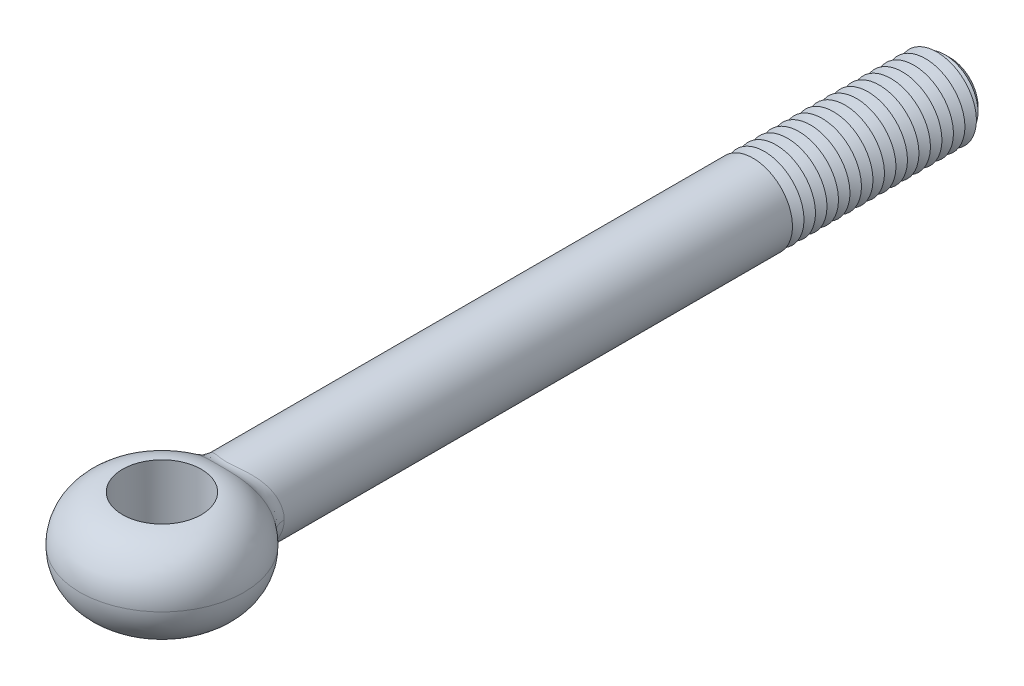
ISO-10303-21;
HEADER;
FILE_DESCRIPTION(('STEP AP214'),'2;1');
FILE_NAME('part.step','',(''),(''),'','','');
FILE_SCHEMA(('AUTOMOTIVE_DESIGN { 1 0 10303 214 1 1 1 1 }'));
ENDSEC;
DATA;
#1=APPLICATION_CONTEXT('core data for automotive mechanical design processes');
#2=APPLICATION_PROTOCOL_DEFINITION('international standard','automotive_design',2000,#1);
#3=PRODUCT_CONTEXT('',#1,'mechanical');
#4=PRODUCT('Part','Part','',(#3));
#5=PRODUCT_RELATED_PRODUCT_CATEGORY('part','',(#4));
#6=PRODUCT_DEFINITION_FORMATION('','',#4);
#7=PRODUCT_DEFINITION_CONTEXT('part definition',#1,'design');
#8=PRODUCT_DEFINITION('design','',#6,#7);
#9=PRODUCT_DEFINITION_SHAPE('','',#8);
#10=(LENGTH_UNIT() NAMED_UNIT(*) SI_UNIT(.MILLI.,.METRE.));
#11=(NAMED_UNIT(*) PLANE_ANGLE_UNIT() SI_UNIT($,.RADIAN.));
#12=(NAMED_UNIT(*) SI_UNIT($,.STERADIAN.) SOLID_ANGLE_UNIT());
#13=UNCERTAINTY_MEASURE_WITH_UNIT(LENGTH_MEASURE(1.E-05),#10,'distance_accuracy_value','');
#14=(GEOMETRIC_REPRESENTATION_CONTEXT(3) GLOBAL_UNCERTAINTY_ASSIGNED_CONTEXT((#13)) GLOBAL_UNIT_ASSIGNED_CONTEXT((#10,
#11,#12)) REPRESENTATION_CONTEXT('',''));
#15=CARTESIAN_POINT('',(0.,0.,0.));
#16=DIRECTION('',(0.,0.,1.));
#17=DIRECTION('',(1.,0.,0.));
#18=AXIS2_PLACEMENT_3D('',#15,#16,#17);
#19=CARTESIAN_POINT('',(0.,0.,-120.));
#20=DIRECTION('',(0.,0.,1.));
#21=DIRECTION('',(1.,0.,0.));
#22=AXIS2_PLACEMENT_3D('',#19,#20,#21);
#23=CYLINDRICAL_SURFACE('',#22,6.);
#24=CARTESIAN_POINT('',(0.,0.,-90.));
#25=DIRECTION('',(0.,0.,-1.));
#26=DIRECTION('',(-1.,0.,0.));
#27=AXIS2_PLACEMENT_3D('',#24,#25,#26);
#28=CIRCLE('',#27,6.);
#29=CARTESIAN_POINT('',(-6.,0.,-90.));
#30=VERTEX_POINT('',#29);
#31=EDGE_CURVE('E79',#30,#30,#28,.T.);
#32=ORIENTED_EDGE('',*,*,#31,.F.);
#33=EDGE_LOOP('',(#32));
#34=FACE_BOUND('',#33,.T.);
#35=CARTESIAN_POINT('',(5.9347688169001,-3.72936552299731,-9.76127797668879));
#36=CARTESIAN_POINT('',(5.01568840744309,-3.30684503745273,-10.6313747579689));
#37=CARTESIAN_POINT('',(4.83579180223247,-3.55177668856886,-11.9305846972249));
#38=CARTESIAN_POINT('',(6.04219931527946,-3.59564214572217,-9.79450956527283));
#39=CARTESIAN_POINT('',(5.09919553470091,-3.1795874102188,-10.6682119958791));
#40=CARTESIAN_POINT('',(4.92935060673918,-3.42442109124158,-11.9860495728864));
#41=CARTESIAN_POINT('',(6.1438473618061,-3.45763550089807,-9.82611020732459));
#42=CARTESIAN_POINT('',(5.17725322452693,-3.05002694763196,-10.702840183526));
#43=CARTESIAN_POINT('',(5.01812074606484,-3.29298619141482,-12.0386936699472));
#44=CARTESIAN_POINT('',(6.33498015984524,-3.17385997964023,-9.8857417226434));
#45=CARTESIAN_POINT('',(5.32290004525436,-2.78639390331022,-10.7677279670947));
#46=CARTESIAN_POINT('',(5.1853986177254,-3.02272379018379,-12.1378881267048));
#47=CARTESIAN_POINT('',(6.42446179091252,-3.02808912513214,-9.91377167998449));
#48=CARTESIAN_POINT('',(5.39041764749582,-2.65235488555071,-10.7979569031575));
#49=CARTESIAN_POINT('',(5.26390371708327,-2.88389440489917,-12.1844369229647));
#50=CARTESIAN_POINT('',(6.59063414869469,-2.72961135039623,-9.96594490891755));
#51=CARTESIAN_POINT('',(5.51491014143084,-2.38053035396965,-10.8538721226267));
#52=CARTESIAN_POINT('',(5.40994102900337,-2.5996298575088,-12.270973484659));
#53=CARTESIAN_POINT('',(6.66732079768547,-2.57690223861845,-9.99008694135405));
#54=CARTESIAN_POINT('',(5.57181683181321,-2.24279354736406,-10.8795284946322));
#55=CARTESIAN_POINT('',(5.47746974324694,-2.45419260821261,-12.3109591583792));
#56=CARTESIAN_POINT('',(6.80727548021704,-2.26566063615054,-10.0342164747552));
#57=CARTESIAN_POINT('',(5.67502497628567,-1.96438787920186,-10.9261769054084));
#58=CARTESIAN_POINT('',(5.60087770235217,-2.1577720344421,-12.3839763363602));
#59=CARTESIAN_POINT('',(6.87054514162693,-2.10712885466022,-10.0542044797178));
#60=CARTESIAN_POINT('',(5.72126980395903,-1.82378259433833,-10.9471437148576));
#61=CARTESIAN_POINT('',(5.65675836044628,-2.00678938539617,-12.4170086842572));
#62=CARTESIAN_POINT('',(7.03602672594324,-1.63406973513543,-10.1065323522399));
#63=CARTESIAN_POINT('',(5.84177866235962,-1.4066595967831,-11.0018788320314));
#64=CARTESIAN_POINT('',(5.80305576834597,-1.55625689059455,-12.5034220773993));
#65=CARTESIAN_POINT('',(7.11911563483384,-1.31267241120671,-10.1328771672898));
#66=CARTESIAN_POINT('',(5.90112324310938,-1.12766751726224,-11.0289752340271));
#67=CARTESIAN_POINT('',(5.87671572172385,-1.2501642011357,-12.5468355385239));
#68=CARTESIAN_POINT('',(7.23011866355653,-0.660856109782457,-10.1680856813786));
#69=CARTESIAN_POINT('',(5.98031743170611,-0.565466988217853,-11.0651706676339));
#70=CARTESIAN_POINT('',(5.97517391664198,-0.629386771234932,-12.6048310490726));
#71=CARTESIAN_POINT('',(7.25807152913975,-0.33044363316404,-10.1769616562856));
#72=CARTESIAN_POINT('',(6.00000388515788,-0.282923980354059,-11.0741952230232));
#73=CARTESIAN_POINT('',(6.0000064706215,-0.314708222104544,-12.6194333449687));
#74=CARTESIAN_POINT('',(7.25805738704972,0.335912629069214,-10.1769567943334));
#75=CARTESIAN_POINT('',(5.99999605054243,0.287606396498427,-11.0741911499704));
#76=CARTESIAN_POINT('',(5.99999342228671,0.319916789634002,-12.6194255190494));
#77=CARTESIAN_POINT('',(7.22915722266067,0.671857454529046,-10.1677796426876));
#78=CARTESIAN_POINT('',(5.97964504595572,0.574876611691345,-11.0648614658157));
#79=CARTESIAN_POINT('',(5.97431882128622,0.63986424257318,-12.6043279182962));
#80=CARTESIAN_POINT('',(7.11452740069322,1.33399050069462,-10.131423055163));
#81=CARTESIAN_POINT('',(5.89784251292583,1.14610230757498,-11.0274778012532));
#82=CARTESIAN_POINT('',(5.87264847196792,1.2704671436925,-12.5444393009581));
#83=CARTESIAN_POINT('',(7.02877559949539,1.66017486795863,-10.1042366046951));
#84=CARTESIAN_POINT('',(5.83657851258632,1.42936262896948,-10.9995093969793));
#85=CARTESIAN_POINT('',(5.79663311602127,1.58111892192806,-12.4996367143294));
#86=CARTESIAN_POINT('',(6.80343893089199,2.2930418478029,-10.0329875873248));
#87=CARTESIAN_POINT('',(5.67253761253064,1.98731296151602,-10.9250177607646));
#88=CARTESIAN_POINT('',(5.59744490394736,2.1838493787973,-12.3819651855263));
#89=CARTESIAN_POINT('',(6.66393326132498,2.59975238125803,-9.98894984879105));
#90=CARTESIAN_POINT('',(5.57019974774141,2.2614449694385,-10.8786920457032));
#91=CARTESIAN_POINT('',(5.47434142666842,2.47595464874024,-12.3091375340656));
#92=CARTESIAN_POINT('',(6.33535121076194,3.18625883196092,-9.88580293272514));
#93=CARTESIAN_POINT('',(5.32389744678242,2.79589244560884,-10.768093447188));
#94=CARTESIAN_POINT('',(5.18560859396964,3.03453222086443,-12.1380393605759));
#95=CARTESIAN_POINT('',(6.14627999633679,3.4660575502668,-9.82669532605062));
#96=CARTESIAN_POINT('',(5.18043230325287,3.05583228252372,-10.7040397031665));
#97=CARTESIAN_POINT('',(5.01998367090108,3.30100719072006,-12.0397714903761));
#98=CARTESIAN_POINT('',(5.7172577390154,4.00014270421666,-9.69400494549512));
#99=CARTESIAN_POINT('',(4.84766875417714,3.56284891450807,-10.5572649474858));
#100=CARTESIAN_POINT('',(4.64637499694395,3.8096597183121,-11.8183006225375));
#101=CARTESIAN_POINT('',(5.47601553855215,4.2534802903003,-9.62005911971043));
#102=CARTESIAN_POINT('',(4.65772328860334,3.80925143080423,-10.4742896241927));
#103=CARTESIAN_POINT('',(4.43732293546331,4.05093360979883,-11.694469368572));
#104=CARTESIAN_POINT('',(5.08259146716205,4.60342640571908,-9.50208552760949));
#105=CARTESIAN_POINT('',(4.34080391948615,4.15825147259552,-10.3388173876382));
#106=CARTESIAN_POINT('',(4.09924731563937,4.38421562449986,-11.4959320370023));
#107=CARTESIAN_POINT('',(4.9460782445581,4.71513594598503,-9.46155286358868));
#108=CARTESIAN_POINT('',(4.23020168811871,4.27084293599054,-10.2919789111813));
#109=CARTESIAN_POINT('',(3.98237779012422,4.49060566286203,-11.4275663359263));
#110=CARTESIAN_POINT('',(4.66296513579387,4.92813376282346,-9.37875537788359));
#111=CARTESIAN_POINT('',(3.99884628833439,4.48804462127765,-10.1953948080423));
#112=CARTESIAN_POINT('',(3.74115278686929,4.6934607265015,-11.2875507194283));
#113=CARTESIAN_POINT('',(4.5163679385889,5.0294247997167,-9.33649101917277));
#114=CARTESIAN_POINT('',(3.87815279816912,4.5926858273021,-10.1456674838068));
#115=CARTESIAN_POINT('',(3.61679930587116,4.78992838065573,-11.2159016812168));
#116=CARTESIAN_POINT('',(4.20225124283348,5.22831182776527,-9.24781094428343));
#117=CARTESIAN_POINT('',(3.61758964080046,4.80051594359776,-10.0403893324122));
#118=CARTESIAN_POINT('',(3.35180476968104,4.97934459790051,-11.0651470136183));
#119=CARTESIAN_POINT('',(4.03398632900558,5.3250780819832,-9.20131965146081));
#120=CARTESIAN_POINT('',(3.47696557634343,4.90311397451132,-9.98467073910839));
#121=CARTESIAN_POINT('',(3.21063957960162,5.07150293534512,-10.9858822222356));
#122=CARTESIAN_POINT('',(3.68652352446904,5.50578905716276,-9.10838168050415));
#123=CARTESIAN_POINT('',(3.18454628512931,5.09703954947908,-9.87225560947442));
#124=CARTESIAN_POINT('',(2.92111983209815,5.24360862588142,-10.8269291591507));
#125=CARTESIAN_POINT('',(3.50732357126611,5.5897313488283,-9.06193501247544));
#126=CARTESIAN_POINT('',(3.03278104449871,5.18843564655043,-9.81555489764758));
#127=CARTESIAN_POINT('',(2.77276391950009,5.32355366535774,-10.7472408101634));
#128=CARTESIAN_POINT('',(3.13794087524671,5.74446425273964,-8.97062224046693));
#129=CARTESIAN_POINT('',(2.71821702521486,5.35884982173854,-9.70314483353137));
#130=CARTESIAN_POINT('',(2.46931336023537,5.47091833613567,-10.5900722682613));
#131=CARTESIAN_POINT('',(2.94775184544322,5.81524723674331,-8.92575706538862));
#132=CARTESIAN_POINT('',(2.55541416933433,5.43794512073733,-9.64741385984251));
#133=CARTESIAN_POINT('',(2.31421486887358,5.53833070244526,-10.5125933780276));
#134=CARTESIAN_POINT('',(2.55657851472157,5.9431564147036,-8.83975050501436));
#135=CARTESIAN_POINT('',(2.21925064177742,5.58238081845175,-9.53980556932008));
#136=CARTESIAN_POINT('',(1.99786735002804,5.66014896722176,-10.3636052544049));
#137=CARTESIAN_POINT('',(2.35559801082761,6.00028737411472,-8.79860782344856));
#138=CARTESIAN_POINT('',(2.04585622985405,5.64781946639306,-9.48788433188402));
#139=CARTESIAN_POINT('',(1.83662049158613,5.71455940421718,-10.2920939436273));
#140=CARTESIAN_POINT('',(1.85774191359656,6.12093796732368,-8.70719486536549));
#141=CARTESIAN_POINT('',(1.61559271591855,5.78713197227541,-9.37194513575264));
#142=CARTESIAN_POINT('',(1.4406271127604,5.82946473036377,-10.1327613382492));
#143=CARTESIAN_POINT('',(1.55532271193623,6.17747996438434,-8.6600942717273));
#144=CARTESIAN_POINT('',(1.3529723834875,5.8538439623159,-9.31142342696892));
#145=CARTESIAN_POINT('',(1.20284157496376,5.88331425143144,-10.0502669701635));
#146=CARTESIAN_POINT('',(1.0891409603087,6.23930337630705,-8.60649289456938));
#147=CARTESIAN_POINT('',(0.947579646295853,5.92726352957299,-9.242285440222));
#148=CARTESIAN_POINT('',(0.83982684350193,5.94219369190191,-9.95617208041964));
#149=CARTESIAN_POINT('',(0.931962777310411,6.25606948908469,-8.59147969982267));
#150=CARTESIAN_POINT('',(0.810874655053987,5.94729550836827,-9.22285403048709));
#151=CARTESIAN_POINT('',(0.718001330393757,5.95816141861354,-9.92977025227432));
#152=CARTESIAN_POINT('',(0.614462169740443,6.2817502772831,-8.56819097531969));
#153=CARTESIAN_POINT('',(0.534722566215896,5.97803723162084,-9.19268813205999));
#154=CARTESIAN_POINT('',(0.472694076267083,5.98261931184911,-9.88878715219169));
#155=CARTESIAN_POINT('',(0.454140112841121,6.29066586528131,-8.5599146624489));
#156=CARTESIAN_POINT('',(0.395193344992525,5.98876738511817,-9.18193414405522));
#157=CARTESIAN_POINT('',(0.349212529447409,5.9911103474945,-9.87420450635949));
#158=CARTESIAN_POINT('',(0.131049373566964,6.30047562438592,-8.55079683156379));
#159=CARTESIAN_POINT('',(0.114068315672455,6.00056854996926,-9.17009294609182));
#160=CARTESIAN_POINT('',(0.100687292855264,6.00045297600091,-9.85813795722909));
#161=CARTESIAN_POINT('',(-0.0317286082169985,6.30131187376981,-8.55000899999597));
#162=CARTESIAN_POINT('',(-0.0276309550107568,6.00157787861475,-9.16906745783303));
#163=CARTESIAN_POINT('',(-0.02436125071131,6.00124940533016,-9.85674863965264));
#164=CARTESIAN_POINT('',(-0.356412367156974,6.29479284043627,-8.55608280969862));
#165=CARTESIAN_POINT('',(-0.31015318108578,5.99373179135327,-9.1769575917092));
#166=CARTESIAN_POINT('',(-0.274003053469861,5.9950408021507,-9.86745275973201));
#167=CARTESIAN_POINT('',(-0.518318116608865,6.28743729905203,-8.56294469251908));
#168=CARTESIAN_POINT('',(-0.451073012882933,5.98487067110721,-9.18587895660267));
#169=CARTESIAN_POINT('',(-0.398596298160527,5.98803552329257,-9.87954662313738));
#170=CARTESIAN_POINT('',(-0.839832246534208,6.26466677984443,-8.583729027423));
#171=CARTESIAN_POINT('',(-0.730746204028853,5.95757663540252,-9.21281914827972));
#172=CARTESIAN_POINT('',(-0.646718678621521,5.96634931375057,-9.91613502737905));
#173=CARTESIAN_POINT('',(-0.999430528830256,6.24922351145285,-8.59767625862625));
#174=CARTESIAN_POINT('',(-0.869577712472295,5.93909230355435,-9.23088715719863));
#175=CARTESIAN_POINT('',(-0.770242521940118,5.95164143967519,-9.94067308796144));
#176=CARTESIAN_POINT('',(-1.31437481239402,6.21055073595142,-8.63153922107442));
#177=CARTESIAN_POINT('',(-1.14330359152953,5.89311724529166,-9.27458059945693));
#178=CARTESIAN_POINT('',(-1.01506554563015,5.91481022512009,-10.0001513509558));
#179=CARTESIAN_POINT('',(-1.46971907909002,6.18731810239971,-8.65145734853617));
#180=CARTESIAN_POINT('',(-1.27826760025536,5.86559591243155,-9.30023316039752));
#181=CARTESIAN_POINT('',(-1.13636381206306,5.89268390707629,-10.0350957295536));
#182=CARTESIAN_POINT('',(-1.82539603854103,6.12454062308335,-8.70327656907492));
#183=CARTESIAN_POINT('',(-1.58698911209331,5.79180104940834,-9.36667644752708));
#184=CARTESIAN_POINT('',(-1.41557604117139,5.83289583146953,-10.1258248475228));
#185=CARTESIAN_POINT('',(-2.02378988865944,6.08214516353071,-8.73696553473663));
#186=CARTESIAN_POINT('',(-1.75893471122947,5.74230420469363,-9.40969592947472));
#187=CARTESIAN_POINT('',(-1.57246341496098,5.79251920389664,-10.184686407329));
#188=CARTESIAN_POINT('',(-2.41092164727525,5.98480792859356,-8.80979727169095));
#189=CARTESIAN_POINT('',(-2.09355200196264,5.63009686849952,-9.50199744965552));
#190=CARTESIAN_POINT('',(-1.880970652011,5.69981707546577,-10.3115469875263));
#191=CARTESIAN_POINT('',(-2.5996560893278,5.92986168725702,-8.84894198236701));
#192=CARTESIAN_POINT('',(-2.25629041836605,5.56730096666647,-9.55133195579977));
#193=CARTESIAN_POINT('',(-2.03258861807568,5.64748732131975,-10.3795492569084));
#194=CARTESIAN_POINT('',(-2.96755778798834,5.80783248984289,-8.93044371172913));
#195=CARTESIAN_POINT('',(-2.57232712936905,5.42968443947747,-9.65322105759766));
#196=CARTESIAN_POINT('',(-2.33036981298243,5.53126903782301,-10.5206862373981));
#197=CARTESIAN_POINT('',(-3.14671697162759,5.74073949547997,-8.97280337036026));
#198=CARTESIAN_POINT('',(-2.72564626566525,5.35477585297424,-9.70581299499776));
#199=CARTESIAN_POINT('',(-2.47652840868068,5.46737094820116,-10.593825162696));
#200=CARTESIAN_POINT('',(-3.49533769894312,5.59480022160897,-9.05896053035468));
#201=CARTESIAN_POINT('',(-3.02253770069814,5.19403391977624,-9.81188119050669));
#202=CARTESIAN_POINT('',(-2.76291205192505,5.32838116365,-10.742122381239));
#203=CARTESIAN_POINT('',(-3.66480050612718,5.51595547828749,-9.10275784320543));
#204=CARTESIAN_POINT('',(-3.16610934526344,5.10813119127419,-9.86537600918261));
#205=CARTESIAN_POINT('',(-2.90313787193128,5.2532909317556,-10.8172804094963));
#206=CARTESIAN_POINT('',(-3.99928684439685,5.34409495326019,-9.19187849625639));
#207=CARTESIAN_POINT('',(-3.44784552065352,4.92340384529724,-9.97329692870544));
#208=CARTESIAN_POINT('',(-3.18162491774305,5.08961424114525,-10.9697608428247));
#209=CARTESIAN_POINT('',(-4.16399459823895,5.25070632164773,-9.23720580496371));
#210=CARTESIAN_POINT('',(-3.58564022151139,4.82420269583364,-10.027694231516));
#211=CARTESIAN_POINT('',(-3.31967954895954,5.00067268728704,-11.0470755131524));
#212=CARTESIAN_POINT('',(-4.48282170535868,5.05207061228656,-9.32687019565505));
#213=CARTESIAN_POINT('',(-3.85050097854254,4.61613017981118,-10.1343299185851));
#214=CARTESIAN_POINT('',(-3.58838451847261,4.8114958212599,-11.1995795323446));
#215=CARTESIAN_POINT('',(-4.63694077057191,4.94682321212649,-9.37120725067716));
#216=CARTESIAN_POINT('',(-3.97751767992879,4.50720729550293,-10.1865592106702));
#217=CARTESIAN_POINT('',(-3.71903465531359,4.71126020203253,-11.2747688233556));
#218=CARTESIAN_POINT('',(-4.93402321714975,4.72498798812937,-9.45797232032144));
#219=CARTESIAN_POINT('',(-4.22045615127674,4.28075328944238,-10.2878502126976));
#220=CARTESIAN_POINT('',(-3.97205735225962,4.49998856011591,-11.421526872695));
#221=CARTESIAN_POINT('',(-5.0769962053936,4.60841012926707,-9.50040196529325));
#222=CARTESIAN_POINT('',(-4.33632375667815,4.16319510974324,-10.3368953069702));
#223=CARTESIAN_POINT('',(-4.09443702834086,4.38896202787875,-11.4930987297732));
#224=CARTESIAN_POINT('',(-5.35139946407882,4.36431803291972,-9.58269705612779));
#225=CARTESIAN_POINT('',(-4.55686646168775,3.92030762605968,-10.4311837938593));
#226=CARTESIAN_POINT('',(-4.3302405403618,4.15649336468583,-11.6315929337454));
#227=CARTESIAN_POINT('',(-5.48282554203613,4.2367998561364,-9.62256156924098));
#228=CARTESIAN_POINT('',(-4.66146230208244,3.79496029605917,-10.476398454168));
#229=CARTESIAN_POINT('',(-4.44366112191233,4.03504748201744,-11.6985135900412));
#230=CARTESIAN_POINT('',(-5.73992249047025,3.96459248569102,-9.70111653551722));
#231=CARTESIAN_POINT('',(-4.86435688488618,3.53075699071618,-10.5647509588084));
#232=CARTESIAN_POINT('',(-4.66626199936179,3.77580236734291,-11.8301121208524));
#233=CARTESIAN_POINT('',(-5.86493730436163,3.81935492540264,-9.73963775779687));
#234=CARTESIAN_POINT('',(-4.96192595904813,3.39157605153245,-10.6076101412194));
#235=CARTESIAN_POINT('',(-4.77491394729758,3.6374808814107,-11.894491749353));
#236=CARTESIAN_POINT('',(-6.10049317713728,3.5184514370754,-9.81259595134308));
#237=CARTESIAN_POINT('',(-5.14414695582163,3.10685040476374,-10.6881097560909));
#238=CARTESIAN_POINT('',(-4.98021019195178,3.35090613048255,-12.0161983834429));
#239=CARTESIAN_POINT('',(-6.21103492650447,3.36278600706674,-9.84703311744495));
#240=CARTESIAN_POINT('',(-5.22870245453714,2.96133570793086,-10.7257098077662));
#241=CARTESIAN_POINT('',(-5.07685506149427,3.20265333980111,-12.0735257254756));
#242=CARTESIAN_POINT('',(-6.41684087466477,3.04200182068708,-9.91136789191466));
#243=CARTESIAN_POINT('',(-5.38481615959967,2.66492089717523,-10.7954268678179));
#244=CARTESIAN_POINT('',(-5.25718892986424,2.89714459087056,-12.1804567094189));
#245=CARTESIAN_POINT('',(-6.51209487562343,2.87687685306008,-9.941262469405));
#246=CARTESIAN_POINT('',(-5.45627120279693,2.51407150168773,-10.8274993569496));
#247=CARTESIAN_POINT('',(-5.34086927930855,2.73988271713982,-12.230055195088));
#248=CARTESIAN_POINT('',(-6.68634060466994,2.53862818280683,-9.99606907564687));
#249=CARTESIAN_POINT('',(-5.58600966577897,2.20820283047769,-10.8859198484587));
#250=CARTESIAN_POINT('',(-5.49420876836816,2.41774112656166,-12.3208709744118));
#251=CARTESIAN_POINT('',(-6.7653416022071,2.365509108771,-10.0209839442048));
#252=CARTESIAN_POINT('',(-5.64421437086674,2.05326176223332,-10.9122330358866));
#253=CARTESIAN_POINT('',(-5.56387589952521,2.25286581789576,-12.3620930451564));
#254=CARTESIAN_POINT('',(-6.90530331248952,2.01532499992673,-10.0651851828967));
#255=CARTESIAN_POINT('',(-5.7466982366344,1.74251049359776,-10.9586742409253));
#256=CARTESIAN_POINT('',(-5.68746016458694,1.91935714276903,-12.4351539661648));
#257=CARTESIAN_POINT('',(-6.96652294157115,1.83836168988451,-10.0845522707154));
#258=CARTESIAN_POINT('',(-5.79110883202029,1.58683531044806,-10.9788602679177));
#259=CARTESIAN_POINT('',(-5.74160317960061,1.75082065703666,-12.4671274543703));
#260=CARTESIAN_POINT('',(-7.07189656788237,1.47955191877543,-10.1179144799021));
#261=CARTESIAN_POINT('',(-5.86721134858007,1.27322299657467,-11.0135080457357));
#262=CARTESIAN_POINT('',(-5.83487815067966,1.40909706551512,-12.5221684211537));
#263=CARTESIAN_POINT('',(-7.11605858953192,1.29770779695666,-10.1319121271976));
#264=CARTESIAN_POINT('',(-5.89885329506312,1.11539297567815,-11.02794716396));
#265=CARTESIAN_POINT('',(-5.87401716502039,1.2359121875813,-12.5452400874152));
#266=CARTESIAN_POINT('',(-7.18688145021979,0.930719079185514,-10.1543694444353));
#267=CARTESIAN_POINT('',(-5.9494736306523,0.79823853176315,-11.0510690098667));
#268=CARTESIAN_POINT('',(-5.93681662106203,0.886399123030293,-12.5822406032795));
#269=CARTESIAN_POINT('',(-7.21355030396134,0.745576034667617,-10.1628316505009));
#270=CARTESIAN_POINT('',(-5.9684191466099,0.639031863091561,-11.0597367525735));
#271=CARTESIAN_POINT('',(-5.96048415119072,0.710072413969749,-12.5961736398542));
#272=CARTESIAN_POINT('',(-7.24914599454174,0.373651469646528,-10.1741279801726));
#273=CARTESIAN_POINT('',(-5.99369065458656,0.319847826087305,-11.0713030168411));
#274=CARTESIAN_POINT('',(-5.99208005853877,0.355858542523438,-12.6147701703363));
#275=CARTESIAN_POINT('',(-7.25807450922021,0.186870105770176,-10.1769626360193));
#276=CARTESIAN_POINT('',(-5.999998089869,0.159994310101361,-11.074193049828));
#277=CARTESIAN_POINT('',(-6.00000992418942,0.17797152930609,-12.6194345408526));
#278=CARTESIAN_POINT('',(-7.25804656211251,-0.335738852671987,-10.1769531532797));
#279=CARTESIAN_POINT('',(-6.0000034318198,-0.287452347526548,-11.0741934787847));
#280=CARTESIAN_POINT('',(-5.99998216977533,-0.31975128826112,-12.6194203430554));
#281=CARTESIAN_POINT('',(-7.22917576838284,-0.671764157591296,-10.1677860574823));
#282=CARTESIAN_POINT('',(-5.97966209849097,-0.574787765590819,-11.0648695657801));
#283=CARTESIAN_POINT('',(-5.97433528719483,-0.639775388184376,-12.6043385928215));
#284=CARTESIAN_POINT('',(-7.1145105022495,-1.33407428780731,-10.1314171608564));
#285=CARTESIAN_POINT('',(-5.8978267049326,-1.14618252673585,-11.0274702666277));
#286=CARTESIAN_POINT('',(-5.8726334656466,-1.27054694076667,-12.5444294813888));
#287=CARTESIAN_POINT('',(-7.02869303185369,-1.66035512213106,-10.1042080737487));
#288=CARTESIAN_POINT('',(-5.83651996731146,-1.42954497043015,-10.999480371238));
#289=CARTESIAN_POINT('',(-5.79655816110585,-1.58129059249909,-12.4995901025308));
#290=CARTESIAN_POINT('',(-6.85971870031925,-2.13500368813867,-10.0507838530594));
#291=CARTESIAN_POINT('',(-5.71335936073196,-1.84847480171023,-10.9435562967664));
#292=CARTESIAN_POINT('',(-5.64719485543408,-2.03333684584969,-12.411356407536));
#293=CARTESIAN_POINT('',(-6.79670689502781,-2.29072029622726,-10.0308806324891));
#294=CARTESIAN_POINT('',(-5.66726413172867,-1.98670630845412,-10.9226633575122));
#295=CARTESIAN_POINT('',(-5.59155053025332,-2.18163837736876,-12.3784603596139));
#296=CARTESIAN_POINT('',(-6.65771758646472,-2.59645969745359,-9.98706290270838));
#297=CARTESIAN_POINT('',(-5.56469443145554,-2.26041067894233,-10.8763159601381));
#298=CARTESIAN_POINT('',(-5.46901133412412,-2.47281875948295,-12.3059514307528));
#299=CARTESIAN_POINT('',(-6.58173903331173,-2.74648202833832,-9.96314806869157));
#300=CARTESIAN_POINT('',(-5.50827469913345,-2.395823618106,-10.8508858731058));
#301=CARTESIAN_POINT('',(-5.40211555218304,-2.61569716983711,-12.2663380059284));
#302=CARTESIAN_POINT('',(-6.41741234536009,-3.03976673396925,-9.91156293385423));
#303=CARTESIAN_POINT('',(-5.38510014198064,-2.6630812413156,-10.7955752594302));
#304=CARTESIAN_POINT('',(-5.25771751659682,-2.89501593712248,-12.180769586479));
#305=CARTESIAN_POINT('',(-6.32906900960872,-3.18303170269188,-9.88389409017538));
#306=CARTESIAN_POINT('',(-5.3184112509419,-2.79488018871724,-10.7657236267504));
#307=CARTESIAN_POINT('',(-5.18021937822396,-3.03145876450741,-12.1348170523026));
#308=CARTESIAN_POINT('',(-6.14060484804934,-3.46203414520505,-9.82510194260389));
#309=CARTESIAN_POINT('',(-5.17475790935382,-3.05416625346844,-10.7017329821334));
#310=CARTESIAN_POINT('',(-5.01528894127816,-3.29717537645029,-12.0370139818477));
#311=CARTESIAN_POINT('',(-6.0404865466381,-3.5977732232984,-9.79397937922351));
#312=CARTESIAN_POINT('',(-5.09786126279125,-3.18162147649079,-10.6676230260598));
#313=CARTESIAN_POINT('',(-4.92785877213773,-3.42645068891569,-11.9851647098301));
#314=CARTESIAN_POINT('',(-5.9347688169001,-3.72936552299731,-9.76127797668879));
#315=CARTESIAN_POINT('',(-5.01568840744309,-3.30684503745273,-10.6313747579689));
#316=CARTESIAN_POINT('',(-4.83579180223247,-3.55177668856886,-11.9305846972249));
#317=(BOUNDED_SURFACE() B_SPLINE_SURFACE(3,2,((#35,#36,#37),(#38,#39,#40),(#41,#42,#43),(#44,
#45,#46),(#47,#48,#49),(#50,#51,#52),(#53,#54,#55),(#56,#57,#58),(#59,#60,#61),(#62,#63,#64),
(#65,#66,#67),(#68,#69,#70),(#71,#72,#73),(#74,#75,#76),(#77,#78,#79),(#80,#81,#82),(#83,#84,
#85),(#86,#87,#88),(#89,#90,#91),(#92,#93,#94),(#95,#96,#97),(#98,#99,#100),(#101,#102,#103),
(#104,#105,#106),(#107,#108,#109),(#110,#111,#112),(#113,#114,#115),(#116,#117,#118),(#119,#120,
#121),(#122,#123,#124),(#125,#126,#127),(#128,#129,#130),(#131,#132,#133),(#134,#135,#136),
(#137,#138,#139),(#140,#141,#142),(#143,#144,#145),(#146,#147,#148),(#149,#150,#151),(#152,#153,
#154),(#155,#156,#157),(#158,#159,#160),(#161,#162,#163),(#164,#165,#166),(#167,#168,#169),
(#170,#171,#172),(#173,#174,#175),(#176,#177,#178),(#179,#180,#181),(#182,#183,#184),(#185,#186,
#187),(#188,#189,#190),(#191,#192,#193),(#194,#195,#196),(#197,#198,#199),(#200,#201,#202),
(#203,#204,#205),(#206,#207,#208),(#209,#210,#211),(#212,#213,#214),(#215,#216,#217),(#218,#219,
#220),(#221,#222,#223),(#224,#225,#226),(#227,#228,#229),(#230,#231,#232),(#233,#234,#235),
(#236,#237,#238),(#239,#240,#241),(#242,#243,#244),(#245,#246,#247),(#248,#249,#250),(#251,#252,
#253),(#254,#255,#256),(#257,#258,#259),(#260,#261,#262),(#263,#264,#265),(#266,#267,#268),
(#269,#270,#271),(#272,#273,#274),(#275,#276,#277),(#278,#279,#280),(#281,#282,#283),(#284,#285,
#286),(#287,#288,#289),(#290,#291,#292),(#293,#294,#295),(#296,#297,#298),(#299,#300,#301),
(#302,#303,#304),(#305,#306,#307),(#308,#309,#310),(#311,#312,#313),(#314,#315,#316)),
.UNSPECIFIED.,.F.,.F.,.F.) B_SPLINE_SURFACE_WITH_KNOTS((4,2,2,2,2,2,2,2,2,2,2,2,2,2,2,2,2,2,2,2,
2,2,2,2,2,2,2,2,2,2,2,2,2,2,2,2,2,2,2,2,2,2,2,2,2,2,4),(3,3),(0.,0.730157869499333,
1.46050265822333,2.19107976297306,2.92156817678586,4.33710286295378,5.75164245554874,
7.18959333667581,8.62810462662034,10.0645045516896,11.5007548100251,12.9777469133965,
13.7173286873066,14.4567140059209,15.2508784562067,16.0451931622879,16.8399668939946,
17.6344627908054,18.7545699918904,19.3125249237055,19.8704149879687,20.4323016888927,
20.9942061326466,21.5580893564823,22.1221991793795,22.8711633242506,23.6203943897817,
24.3702474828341,25.1200026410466,25.8937593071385,26.6675370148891,27.440640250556,
28.214023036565,29.0276778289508,29.8412937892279,30.6554502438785,31.4691410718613,
32.2703098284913,33.0711012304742,33.8715254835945,34.6718740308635,36.109814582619,
37.5483362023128,38.2672339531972,38.986189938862,39.7048676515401,40.4233915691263),(0.,1.),
.UNSPECIFIED.) GEOMETRIC_REPRESENTATION_ITEM() RATIONAL_B_SPLINE_SURFACE(((1.,0.913704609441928,
1.),(1.,0.911808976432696,1.),(1.,0.909987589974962,1.),(1.,0.906521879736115,1.),(1.,
0.904877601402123,1.),(1.,0.901795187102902,1.),(1.,0.900357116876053,1.),(1.,0.897712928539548,
1.),(1.,0.896506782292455,1.),(1.,0.893335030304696,1.),(1.,0.891717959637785,1.),(1.,
0.889551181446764,1.),(1.,0.889000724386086,1.),(1.,0.88900105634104,1.),(1.,0.889570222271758,
1.),(1.,0.891807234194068,1.),(1.,0.893475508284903,1.),(1.,0.897791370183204,1.),(1.,
0.900437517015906,1.),(1.,0.90652846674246,1.),(1.,0.909973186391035,1.),(1.,0.917541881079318,
1.),(1.,0.921682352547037,1.),(1.,0.928122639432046,1.),(1.,0.930309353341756,1.),(1.,
0.934718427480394,1.),(1.,0.936940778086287,1.),(1.,0.941540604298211,1.),(1.,0.943917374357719,
1.),(1.,0.948597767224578,1.),(1.,0.9509013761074,1.),(1.,0.955362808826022,1.),(1.,
0.957520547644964,1.),(1.,0.961598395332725,1.),(1.,0.963518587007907,1.),(1.,0.967731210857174,
1.),(1.,0.969853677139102,1.),(1.,0.972244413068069,1.),(1.,0.972908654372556,1.),(1.,
0.973935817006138,1.),(1.,0.97429877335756,1.),(1.,0.974698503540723,1.),(1.,0.974732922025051,
1.),(1.,0.974466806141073,1.),(1.,0.974166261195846,1.),(1.,0.973250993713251,1.),(1.,
0.972635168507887,1.),(1.,0.9711286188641,1.),(1.,0.970237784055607,1.),(1.,0.967898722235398,
1.),(1.,0.966363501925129,1.),(1.,0.962996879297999,1.),(1.,0.961165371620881,1.),(1.,
0.957295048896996,1.),(1.,0.955256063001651,1.),(1.,0.951046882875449,1.),(1.,0.948876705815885,
1.),(1.,0.944396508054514,1.),(1.,0.942084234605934,1.),(1.,0.937444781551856,1.),(1.,
0.935117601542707,1.),(1.,0.93050246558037,1.),(1.,0.928214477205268,1.),(1.,0.923722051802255,
1.),(1.,0.921517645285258,1.),(1.,0.917125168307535,1.),(1.,0.914943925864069,1.),(1.,
0.910769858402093,1.),(1.,0.90877702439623,1.),(1.,0.905020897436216,1.),(1.,0.903257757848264,
1.),(1.,0.900001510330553,1.),(1.,0.898508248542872,1.),(1.,0.895843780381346,1.),(1.,
0.894667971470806,1.),(1.,0.892634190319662,1.),(1.,0.891776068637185,1.),(1.,0.890395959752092,
1.),(1.,0.889873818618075,1.),(1.,0.889176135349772,1.),(1.,0.889000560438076,1.),(1.,
0.889001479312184,1.),(1.,0.889569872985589,1.),(1.,0.89180755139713,1.),(1.,0.893477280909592,
1.),(1.,0.896713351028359,1.),(1.,0.897913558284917,1.),(1.,0.900537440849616,1.),(1.,
0.901961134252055,1.),(1.,0.905007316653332,1.),(1.,0.906629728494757,1.),(1.,0.910045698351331,
1.),(1.,0.911839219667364,1.),(1.,0.913704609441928,1.))) REPRESENTATION_ITEM('') SURFACE());
#318=CARTESIAN_POINT('',(-4.83579180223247,-3.55177668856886,-11.9305846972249));
#319=CARTESIAN_POINT('',(-4.92785877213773,-3.42645068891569,-11.9851647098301));
#320=CARTESIAN_POINT('',(-5.01528894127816,-3.29717537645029,-12.0370139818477));
#321=CARTESIAN_POINT('',(-5.18021937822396,-3.03145876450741,-12.1348170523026));
#322=CARTESIAN_POINT('',(-5.25771751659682,-2.89501593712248,-12.180769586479));
#323=CARTESIAN_POINT('',(-5.40211555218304,-2.61569716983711,-12.2663380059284));
#324=CARTESIAN_POINT('',(-5.46901133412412,-2.47281875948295,-12.3059514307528));
#325=CARTESIAN_POINT('',(-5.59155053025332,-2.18163837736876,-12.3784603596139));
#326=CARTESIAN_POINT('',(-5.64719485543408,-2.03333684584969,-12.411356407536));
#327=CARTESIAN_POINT('',(-5.79655816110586,-1.5812905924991,-12.4995901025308));
#328=CARTESIAN_POINT('',(-5.8726334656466,-1.27054694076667,-12.5444294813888));
#329=CARTESIAN_POINT('',(-5.97433528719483,-0.639775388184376,-12.6043385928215));
#330=CARTESIAN_POINT('',(-5.99998216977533,-0.31975128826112,-12.6194203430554));
#331=CARTESIAN_POINT('',(-6.00000992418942,0.17797152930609,-12.6194345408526));
#332=CARTESIAN_POINT('',(-5.99208005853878,0.355858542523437,-12.6147701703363));
#333=CARTESIAN_POINT('',(-5.96048415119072,0.71007241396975,-12.5961736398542));
#334=CARTESIAN_POINT('',(-5.93681662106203,0.886399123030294,-12.5822406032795));
#335=CARTESIAN_POINT('',(-5.87401716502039,1.2359121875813,-12.5452400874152));
#336=CARTESIAN_POINT('',(-5.83487815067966,1.40909706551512,-12.5221684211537));
#337=CARTESIAN_POINT('',(-5.74160317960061,1.75082065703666,-12.4671274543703));
#338=CARTESIAN_POINT('',(-5.68746016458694,1.91935714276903,-12.4351539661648));
#339=CARTESIAN_POINT('',(-5.56387589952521,2.25286581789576,-12.3620930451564));
#340=CARTESIAN_POINT('',(-5.49420876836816,2.41774112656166,-12.3208709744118));
#341=CARTESIAN_POINT('',(-5.34086927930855,2.73988271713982,-12.230055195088));
#342=CARTESIAN_POINT('',(-5.25718892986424,2.89714459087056,-12.1804567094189));
#343=CARTESIAN_POINT('',(-5.07685506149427,3.20265333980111,-12.0735257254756));
#344=CARTESIAN_POINT('',(-4.98021019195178,3.35090613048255,-12.0161983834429));
#345=CARTESIAN_POINT('',(-4.77491394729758,3.6374808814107,-11.894491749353));
#346=CARTESIAN_POINT('',(-4.66626199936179,3.77580236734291,-11.8301121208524));
#347=CARTESIAN_POINT('',(-4.44366112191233,4.03504748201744,-11.6985135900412));
#348=CARTESIAN_POINT('',(-4.3302405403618,4.15649336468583,-11.6315929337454));
#349=CARTESIAN_POINT('',(-4.09443702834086,4.38896202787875,-11.4930987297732));
#350=CARTESIAN_POINT('',(-3.97205735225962,4.49998856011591,-11.421526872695));
#351=CARTESIAN_POINT('',(-3.71903465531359,4.71126020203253,-11.2747688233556));
#352=CARTESIAN_POINT('',(-3.58838451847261,4.8114958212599,-11.1995795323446));
#353=CARTESIAN_POINT('',(-3.31967954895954,5.00067268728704,-11.0470755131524));
#354=CARTESIAN_POINT('',(-3.18162491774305,5.08961424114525,-10.9697608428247));
#355=CARTESIAN_POINT('',(-2.90313787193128,5.2532909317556,-10.8172804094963));
#356=CARTESIAN_POINT('',(-2.76291205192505,5.32838116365,-10.742122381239));
#357=CARTESIAN_POINT('',(-2.47652840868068,5.46737094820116,-10.593825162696));
#358=CARTESIAN_POINT('',(-2.33036981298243,5.53126903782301,-10.5206862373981));
#359=CARTESIAN_POINT('',(-2.03258861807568,5.64748732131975,-10.3795492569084));
#360=CARTESIAN_POINT('',(-1.880970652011,5.69981707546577,-10.3115469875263));
#361=CARTESIAN_POINT('',(-1.57246341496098,5.79251920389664,-10.184686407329));
#362=CARTESIAN_POINT('',(-1.41557604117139,5.83289583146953,-10.1258248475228));
#363=CARTESIAN_POINT('',(-1.13636381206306,5.89268390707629,-10.0350957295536));
#364=CARTESIAN_POINT('',(-1.01506554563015,5.91481022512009,-10.0001513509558));
#365=CARTESIAN_POINT('',(-0.770242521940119,5.95164143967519,-9.94067308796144));
#366=CARTESIAN_POINT('',(-0.64671867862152,5.96634931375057,-9.91613502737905));
#367=CARTESIAN_POINT('',(-0.398596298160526,5.98803552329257,-9.87954662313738));
#368=CARTESIAN_POINT('',(-0.274003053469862,5.9950408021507,-9.86745275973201));
#369=CARTESIAN_POINT('',(-0.0243612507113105,6.00124940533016,-9.85674863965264));
#370=CARTESIAN_POINT('',(0.100687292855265,6.00045297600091,-9.85813795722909));
#371=CARTESIAN_POINT('',(0.34921252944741,5.9911103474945,-9.87420450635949));
#372=CARTESIAN_POINT('',(0.472694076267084,5.98261931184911,-9.88878715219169));
#373=CARTESIAN_POINT('',(0.718001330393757,5.95816141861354,-9.92977025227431));
#374=CARTESIAN_POINT('',(0.83982684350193,5.94219369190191,-9.95617208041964));
#375=CARTESIAN_POINT('',(1.20284157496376,5.88331425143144,-10.0502669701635));
#376=CARTESIAN_POINT('',(1.4406271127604,5.82946473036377,-10.1327613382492));
#377=CARTESIAN_POINT('',(1.83662049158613,5.71455940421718,-10.2920939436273));
#378=CARTESIAN_POINT('',(1.99786735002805,5.66014896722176,-10.3636052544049));
#379=CARTESIAN_POINT('',(2.31421486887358,5.53833070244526,-10.5125933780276));
#380=CARTESIAN_POINT('',(2.46931336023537,5.47091833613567,-10.5900722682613));
#381=CARTESIAN_POINT('',(2.77276391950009,5.32355366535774,-10.7472408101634));
#382=CARTESIAN_POINT('',(2.92111983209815,5.24360862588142,-10.8269291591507));
#383=CARTESIAN_POINT('',(3.21063957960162,5.07150293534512,-10.9858822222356));
#384=CARTESIAN_POINT('',(3.35180476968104,4.97934459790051,-11.0651470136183));
#385=CARTESIAN_POINT('',(3.61679930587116,4.78992838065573,-11.2159016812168));
#386=CARTESIAN_POINT('',(3.74115278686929,4.6934607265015,-11.2875507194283));
#387=CARTESIAN_POINT('',(3.98237779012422,4.49060566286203,-11.4275663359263));
#388=CARTESIAN_POINT('',(4.09924731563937,4.38421562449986,-11.4959320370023));
#389=CARTESIAN_POINT('',(4.43732293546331,4.05093360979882,-11.694469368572));
#390=CARTESIAN_POINT('',(4.64637499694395,3.8096597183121,-11.8183006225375));
#391=CARTESIAN_POINT('',(5.01998367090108,3.30100719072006,-12.0397714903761));
#392=CARTESIAN_POINT('',(5.18560859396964,3.03453222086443,-12.1380393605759));
#393=CARTESIAN_POINT('',(5.47434142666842,2.47595464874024,-12.3091375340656));
#394=CARTESIAN_POINT('',(5.59744490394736,2.1838493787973,-12.3819651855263));
#395=CARTESIAN_POINT('',(5.79663311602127,1.58111892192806,-12.4996367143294));
#396=CARTESIAN_POINT('',(5.87264847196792,1.2704671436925,-12.5444393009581));
#397=CARTESIAN_POINT('',(5.97431882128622,0.63986424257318,-12.6043279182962));
#398=CARTESIAN_POINT('',(5.99999342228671,0.319916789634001,-12.6194255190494));
#399=CARTESIAN_POINT('',(6.0000064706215,-0.314708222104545,-12.6194333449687));
#400=CARTESIAN_POINT('',(5.97517391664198,-0.629386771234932,-12.6048310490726));
#401=CARTESIAN_POINT('',(5.87671572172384,-1.2501642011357,-12.5468355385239));
#402=CARTESIAN_POINT('',(5.80305576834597,-1.55625689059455,-12.5034220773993));
#403=CARTESIAN_POINT('',(5.65675836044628,-2.00678938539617,-12.4170086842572));
#404=CARTESIAN_POINT('',(5.60087770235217,-2.1577720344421,-12.3839763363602));
#405=CARTESIAN_POINT('',(5.47746974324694,-2.45419260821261,-12.3109591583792));
#406=CARTESIAN_POINT('',(5.40994102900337,-2.5996298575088,-12.270973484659));
#407=CARTESIAN_POINT('',(5.26390371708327,-2.88389440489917,-12.1844369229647));
#408=CARTESIAN_POINT('',(5.1853986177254,-3.02272379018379,-12.1378881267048));
#409=CARTESIAN_POINT('',(5.01812074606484,-3.29298619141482,-12.0386936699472));
#410=CARTESIAN_POINT('',(4.92935060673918,-3.42442109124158,-11.9860495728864));
#411=CARTESIAN_POINT('',(4.83579180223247,-3.55177668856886,-11.9305846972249));
#412=B_SPLINE_CURVE_WITH_KNOTS('',3,(#318,#319,#320,#321,#322,#323,#324,#325,#326,#327,#328,
#329,#330,#331,#332,#333,#334,#335,#336,#337,#338,#339,#340,#341,#342,#343,#344,#345,#346,#347,
#348,#349,#350,#351,#352,#353,#354,#355,#356,#357,#358,#359,#360,#361,#362,#363,#364,#365,#366,
#367,#368,#369,#370,#371,#372,#373,#374,#375,#376,#377,#378,#379,#380,#381,#382,#383,#384,#385,
#386,#387,#388,#389,#390,#391,#392,#393,#394,#395,#396,#397,#398,#399,#400,#401,#402,#403,#404,
#405,#406,#407,#408,#409,#410,#411),.UNSPECIFIED.,.F.,.F.,(4,2,2,2,2,2,2,2,2,2,2,2,2,2,2,2,2,2,
2,2,2,2,2,2,2,2,2,2,2,2,2,2,2,2,2,2,2,2,2,2,2,2,2,2,2,2,4),(0.,0.718523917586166,
1.43720163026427,2.15615761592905,2.87505536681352,4.31357698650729,5.7515175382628,
6.55186608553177,7.35229033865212,8.15308174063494,8.95425049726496,9.76794132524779,
10.5820977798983,11.3957137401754,12.2093685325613,12.9827513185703,13.7558545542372,
14.5296322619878,15.3033889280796,16.0531440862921,16.8029971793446,17.5522282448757,
18.3011923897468,18.865302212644,19.4291854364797,19.9910898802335,20.5529765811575,
21.1108666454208,21.6688215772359,22.7889287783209,23.5834246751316,24.3781984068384,
25.1725131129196,25.9666775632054,26.7060628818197,27.4456446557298,28.9226367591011,
30.3588870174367,31.7952869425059,33.2337982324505,34.6717491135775,36.0862887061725,
37.5018233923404,38.2323118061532,38.9628889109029,39.6932336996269,40.4233915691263),.UNSPECIFIED.);
#413=CARTESIAN_POINT('',(-6.,0.,-12.619429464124));
#414=VERTEX_POINT('',#413);
#415=CARTESIAN_POINT('',(6.,0.,-12.619429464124));
#416=VERTEX_POINT('',#415);
#417=EDGE_CURVE('E81',#414,#416,#412,.T.);
#418=ORIENTED_EDGE('',*,*,#417,.T.);
#419=CARTESIAN_POINT('',(-5.9347688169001,3.72936552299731,-9.76127797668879));
#420=CARTESIAN_POINT('',(-5.01568840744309,3.30684503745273,-10.6313747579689));
#421=CARTESIAN_POINT('',(-4.83579180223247,3.55177668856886,-11.9305846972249));
#422=CARTESIAN_POINT('',(-6.04219931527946,3.59564214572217,-9.79450956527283));
#423=CARTESIAN_POINT('',(-5.09919553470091,3.1795874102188,-10.6682119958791));
#424=CARTESIAN_POINT('',(-4.92935060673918,3.42442109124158,-11.9860495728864));
#425=CARTESIAN_POINT('',(-6.1438473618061,3.45763550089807,-9.82611020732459));
#426=CARTESIAN_POINT('',(-5.17725322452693,3.05002694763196,-10.702840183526));
#427=CARTESIAN_POINT('',(-5.01812074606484,3.29298619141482,-12.0386936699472));
#428=CARTESIAN_POINT('',(-6.33498015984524,3.17385997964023,-9.8857417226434));
#429=CARTESIAN_POINT('',(-5.32290004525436,2.78639390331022,-10.7677279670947));
#430=CARTESIAN_POINT('',(-5.1853986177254,3.02272379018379,-12.1378881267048));
#431=CARTESIAN_POINT('',(-6.42446179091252,3.02808912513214,-9.91377167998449));
#432=CARTESIAN_POINT('',(-5.39041764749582,2.65235488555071,-10.7979569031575));
#433=CARTESIAN_POINT('',(-5.26390371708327,2.88389440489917,-12.1844369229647));
#434=CARTESIAN_POINT('',(-6.59063414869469,2.72961135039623,-9.96594490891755));
#435=CARTESIAN_POINT('',(-5.51491014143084,2.38053035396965,-10.8538721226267));
#436=CARTESIAN_POINT('',(-5.40994102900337,2.5996298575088,-12.270973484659));
#437=CARTESIAN_POINT('',(-6.66732079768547,2.57690223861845,-9.99008694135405));
#438=CARTESIAN_POINT('',(-5.57181683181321,2.24279354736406,-10.8795284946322));
#439=CARTESIAN_POINT('',(-5.47746974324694,2.45419260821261,-12.3109591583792));
#440=CARTESIAN_POINT('',(-6.80727548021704,2.26566063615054,-10.0342164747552));
#441=CARTESIAN_POINT('',(-5.67502497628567,1.96438787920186,-10.9261769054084));
#442=CARTESIAN_POINT('',(-5.60087770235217,2.1577720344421,-12.3839763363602));
#443=CARTESIAN_POINT('',(-6.87054514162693,2.10712885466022,-10.0542044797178));
#444=CARTESIAN_POINT('',(-5.72126980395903,1.82378259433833,-10.9471437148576));
#445=CARTESIAN_POINT('',(-5.65675836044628,2.00678938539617,-12.4170086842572));
#446=CARTESIAN_POINT('',(-7.03602672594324,1.63406973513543,-10.1065323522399));
#447=CARTESIAN_POINT('',(-5.84177866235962,1.4066595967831,-11.0018788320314));
#448=CARTESIAN_POINT('',(-5.80305576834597,1.55625689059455,-12.5034220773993));
#449=CARTESIAN_POINT('',(-7.11911563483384,1.31267241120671,-10.1328771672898));
#450=CARTESIAN_POINT('',(-5.90112324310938,1.12766751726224,-11.0289752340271));
#451=CARTESIAN_POINT('',(-5.87671572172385,1.2501642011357,-12.5468355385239));
#452=CARTESIAN_POINT('',(-7.23011866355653,0.660856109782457,-10.1680856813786));
#453=CARTESIAN_POINT('',(-5.98031743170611,0.565466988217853,-11.0651706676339));
#454=CARTESIAN_POINT('',(-5.97517391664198,0.629386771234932,-12.6048310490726));
#455=CARTESIAN_POINT('',(-7.25807152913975,0.33044363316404,-10.1769616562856));
#456=CARTESIAN_POINT('',(-6.00000388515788,0.282923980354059,-11.0741952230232));
#457=CARTESIAN_POINT('',(-6.0000064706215,0.314708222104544,-12.6194333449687));
#458=CARTESIAN_POINT('',(-7.25805738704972,-0.335912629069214,-10.1769567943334));
#459=CARTESIAN_POINT('',(-5.99999605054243,-0.287606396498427,-11.0741911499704));
#460=CARTESIAN_POINT('',(-5.99999342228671,-0.319916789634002,-12.6194255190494));
#461=CARTESIAN_POINT('',(-7.22915722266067,-0.671857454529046,-10.1677796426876));
#462=CARTESIAN_POINT('',(-5.97964504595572,-0.574876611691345,-11.0648614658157));
#463=CARTESIAN_POINT('',(-5.97431882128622,-0.63986424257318,-12.6043279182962));
#464=CARTESIAN_POINT('',(-7.11452740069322,-1.33399050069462,-10.131423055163));
#465=CARTESIAN_POINT('',(-5.89784251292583,-1.14610230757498,-11.0274778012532));
#466=CARTESIAN_POINT('',(-5.87264847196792,-1.2704671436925,-12.5444393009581));
#467=CARTESIAN_POINT('',(-7.02877559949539,-1.66017486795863,-10.1042366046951));
#468=CARTESIAN_POINT('',(-5.83657851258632,-1.42936262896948,-10.9995093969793));
#469=CARTESIAN_POINT('',(-5.79663311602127,-1.58111892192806,-12.4996367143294));
#470=CARTESIAN_POINT('',(-6.80343893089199,-2.2930418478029,-10.0329875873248));
#471=CARTESIAN_POINT('',(-5.67253761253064,-1.98731296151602,-10.9250177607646));
#472=CARTESIAN_POINT('',(-5.59744490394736,-2.1838493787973,-12.3819651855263));
#473=CARTESIAN_POINT('',(-6.66393326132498,-2.59975238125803,-9.98894984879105));
#474=CARTESIAN_POINT('',(-5.57019974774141,-2.2614449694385,-10.8786920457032));
#475=CARTESIAN_POINT('',(-5.47434142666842,-2.47595464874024,-12.3091375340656));
#476=CARTESIAN_POINT('',(-6.33535121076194,-3.18625883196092,-9.88580293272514));
#477=CARTESIAN_POINT('',(-5.32389744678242,-2.79589244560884,-10.768093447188));
#478=CARTESIAN_POINT('',(-5.18560859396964,-3.03453222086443,-12.1380393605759));
#479=CARTESIAN_POINT('',(-6.14627999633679,-3.4660575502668,-9.82669532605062));
#480=CARTESIAN_POINT('',(-5.18043230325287,-3.05583228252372,-10.7040397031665));
#481=CARTESIAN_POINT('',(-5.01998367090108,-3.30100719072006,-12.0397714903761));
#482=CARTESIAN_POINT('',(-5.7172577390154,-4.00014270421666,-9.69400494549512));
#483=CARTESIAN_POINT('',(-4.84766875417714,-3.56284891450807,-10.5572649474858));
#484=CARTESIAN_POINT('',(-4.64637499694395,-3.8096597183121,-11.8183006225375));
#485=CARTESIAN_POINT('',(-5.47601553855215,-4.2534802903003,-9.62005911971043));
#486=CARTESIAN_POINT('',(-4.65772328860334,-3.80925143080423,-10.4742896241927));
#487=CARTESIAN_POINT('',(-4.43732293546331,-4.05093360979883,-11.694469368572));
#488=CARTESIAN_POINT('',(-5.08259146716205,-4.60342640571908,-9.50208552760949));
#489=CARTESIAN_POINT('',(-4.34080391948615,-4.15825147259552,-10.3388173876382));
#490=CARTESIAN_POINT('',(-4.09924731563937,-4.38421562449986,-11.4959320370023));
#491=CARTESIAN_POINT('',(-4.9460782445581,-4.71513594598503,-9.46155286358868));
#492=CARTESIAN_POINT('',(-4.23020168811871,-4.27084293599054,-10.2919789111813));
#493=CARTESIAN_POINT('',(-3.98237779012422,-4.49060566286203,-11.4275663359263));
#494=CARTESIAN_POINT('',(-4.66296513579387,-4.92813376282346,-9.37875537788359));
#495=CARTESIAN_POINT('',(-3.99884628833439,-4.48804462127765,-10.1953948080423));
#496=CARTESIAN_POINT('',(-3.74115278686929,-4.6934607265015,-11.2875507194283));
#497=CARTESIAN_POINT('',(-4.5163679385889,-5.0294247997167,-9.33649101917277));
#498=CARTESIAN_POINT('',(-3.87815279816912,-4.5926858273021,-10.1456674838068));
#499=CARTESIAN_POINT('',(-3.61679930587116,-4.78992838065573,-11.2159016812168));
#500=CARTESIAN_POINT('',(-4.20225124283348,-5.22831182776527,-9.24781094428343));
#501=CARTESIAN_POINT('',(-3.61758964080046,-4.80051594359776,-10.0403893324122));
#502=CARTESIAN_POINT('',(-3.35180476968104,-4.97934459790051,-11.0651470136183));
#503=CARTESIAN_POINT('',(-4.03398632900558,-5.3250780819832,-9.20131965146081));
#504=CARTESIAN_POINT('',(-3.47696557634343,-4.90311397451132,-9.98467073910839));
#505=CARTESIAN_POINT('',(-3.21063957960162,-5.07150293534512,-10.9858822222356));
#506=CARTESIAN_POINT('',(-3.68652352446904,-5.50578905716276,-9.10838168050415));
#507=CARTESIAN_POINT('',(-3.18454628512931,-5.09703954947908,-9.87225560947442));
#508=CARTESIAN_POINT('',(-2.92111983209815,-5.24360862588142,-10.8269291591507));
#509=CARTESIAN_POINT('',(-3.50732357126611,-5.5897313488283,-9.06193501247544));
#510=CARTESIAN_POINT('',(-3.03278104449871,-5.18843564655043,-9.81555489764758));
#511=CARTESIAN_POINT('',(-2.77276391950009,-5.32355366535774,-10.7472408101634));
#512=CARTESIAN_POINT('',(-3.13794087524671,-5.74446425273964,-8.97062224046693));
#513=CARTESIAN_POINT('',(-2.71821702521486,-5.35884982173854,-9.70314483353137));
#514=CARTESIAN_POINT('',(-2.46931336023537,-5.47091833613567,-10.5900722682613));
#515=CARTESIAN_POINT('',(-2.94775184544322,-5.81524723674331,-8.92575706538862));
#516=CARTESIAN_POINT('',(-2.55541416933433,-5.43794512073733,-9.64741385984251));
#517=CARTESIAN_POINT('',(-2.31421486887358,-5.53833070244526,-10.5125933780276));
#518=CARTESIAN_POINT('',(-2.55657851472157,-5.9431564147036,-8.83975050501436));
#519=CARTESIAN_POINT('',(-2.21925064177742,-5.58238081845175,-9.53980556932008));
#520=CARTESIAN_POINT('',(-1.99786735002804,-5.66014896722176,-10.3636052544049));
#521=CARTESIAN_POINT('',(-2.35559801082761,-6.00028737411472,-8.79860782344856));
#522=CARTESIAN_POINT('',(-2.04585622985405,-5.64781946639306,-9.48788433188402));
#523=CARTESIAN_POINT('',(-1.83662049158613,-5.71455940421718,-10.2920939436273));
#524=CARTESIAN_POINT('',(-1.85774191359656,-6.12093796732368,-8.70719486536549));
#525=CARTESIAN_POINT('',(-1.61559271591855,-5.78713197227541,-9.37194513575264));
#526=CARTESIAN_POINT('',(-1.4406271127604,-5.82946473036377,-10.1327613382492));
#527=CARTESIAN_POINT('',(-1.55532271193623,-6.17747996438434,-8.6600942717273));
#528=CARTESIAN_POINT('',(-1.3529723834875,-5.8538439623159,-9.31142342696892));
#529=CARTESIAN_POINT('',(-1.20284157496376,-5.88331425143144,-10.0502669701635));
#530=CARTESIAN_POINT('',(-1.0891409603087,-6.23930337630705,-8.60649289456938));
#531=CARTESIAN_POINT('',(-0.947579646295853,-5.92726352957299,-9.242285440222));
#532=CARTESIAN_POINT('',(-0.83982684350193,-5.94219369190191,-9.95617208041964));
#533=CARTESIAN_POINT('',(-0.931962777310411,-6.25606948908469,-8.59147969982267));
#534=CARTESIAN_POINT('',(-0.810874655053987,-5.94729550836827,-9.22285403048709));
#535=CARTESIAN_POINT('',(-0.718001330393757,-5.95816141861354,-9.92977025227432));
#536=CARTESIAN_POINT('',(-0.614462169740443,-6.2817502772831,-8.56819097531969));
#537=CARTESIAN_POINT('',(-0.534722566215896,-5.97803723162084,-9.19268813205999));
#538=CARTESIAN_POINT('',(-0.472694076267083,-5.98261931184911,-9.88878715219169));
#539=CARTESIAN_POINT('',(-0.454140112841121,-6.29066586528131,-8.5599146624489));
#540=CARTESIAN_POINT('',(-0.395193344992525,-5.98876738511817,-9.18193414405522));
#541=CARTESIAN_POINT('',(-0.349212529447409,-5.9911103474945,-9.87420450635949));
#542=CARTESIAN_POINT('',(-0.131049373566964,-6.30047562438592,-8.55079683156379));
#543=CARTESIAN_POINT('',(-0.114068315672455,-6.00056854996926,-9.17009294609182));
#544=CARTESIAN_POINT('',(-0.100687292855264,-6.00045297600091,-9.85813795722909));
#545=CARTESIAN_POINT('',(0.0317286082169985,-6.30131187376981,-8.55000899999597));
#546=CARTESIAN_POINT('',(0.0276309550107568,-6.00157787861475,-9.16906745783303));
#547=CARTESIAN_POINT('',(0.02436125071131,-6.00124940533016,-9.85674863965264));
#548=CARTESIAN_POINT('',(0.356412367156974,-6.29479284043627,-8.55608280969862));
#549=CARTESIAN_POINT('',(0.31015318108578,-5.99373179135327,-9.1769575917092));
#550=CARTESIAN_POINT('',(0.274003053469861,-5.9950408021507,-9.86745275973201));
#551=CARTESIAN_POINT('',(0.518318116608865,-6.28743729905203,-8.56294469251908));
#552=CARTESIAN_POINT('',(0.451073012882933,-5.98487067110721,-9.18587895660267));
#553=CARTESIAN_POINT('',(0.398596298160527,-5.98803552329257,-9.87954662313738));
#554=CARTESIAN_POINT('',(0.839832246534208,-6.26466677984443,-8.583729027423));
#555=CARTESIAN_POINT('',(0.730746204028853,-5.95757663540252,-9.21281914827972));
#556=CARTESIAN_POINT('',(0.646718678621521,-5.96634931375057,-9.91613502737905));
#557=CARTESIAN_POINT('',(0.999430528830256,-6.24922351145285,-8.59767625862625));
#558=CARTESIAN_POINT('',(0.869577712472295,-5.93909230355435,-9.23088715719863));
#559=CARTESIAN_POINT('',(0.770242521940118,-5.95164143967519,-9.94067308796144));
#560=CARTESIAN_POINT('',(1.31437481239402,-6.21055073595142,-8.63153922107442));
#561=CARTESIAN_POINT('',(1.14330359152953,-5.89311724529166,-9.27458059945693));
#562=CARTESIAN_POINT('',(1.01506554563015,-5.91481022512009,-10.0001513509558));
#563=CARTESIAN_POINT('',(1.46971907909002,-6.18731810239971,-8.65145734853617));
#564=CARTESIAN_POINT('',(1.27826760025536,-5.86559591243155,-9.30023316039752));
#565=CARTESIAN_POINT('',(1.13636381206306,-5.89268390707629,-10.0350957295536));
#566=CARTESIAN_POINT('',(1.82539603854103,-6.12454062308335,-8.70327656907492));
#567=CARTESIAN_POINT('',(1.58698911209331,-5.79180104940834,-9.36667644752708));
#568=CARTESIAN_POINT('',(1.41557604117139,-5.83289583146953,-10.1258248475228));
#569=CARTESIAN_POINT('',(2.02378988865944,-6.08214516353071,-8.73696553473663));
#570=CARTESIAN_POINT('',(1.75893471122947,-5.74230420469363,-9.40969592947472));
#571=CARTESIAN_POINT('',(1.57246341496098,-5.79251920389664,-10.184686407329));
#572=CARTESIAN_POINT('',(2.41092164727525,-5.98480792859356,-8.80979727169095));
#573=CARTESIAN_POINT('',(2.09355200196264,-5.63009686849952,-9.50199744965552));
#574=CARTESIAN_POINT('',(1.880970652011,-5.69981707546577,-10.3115469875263));
#575=CARTESIAN_POINT('',(2.5996560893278,-5.92986168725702,-8.84894198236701));
#576=CARTESIAN_POINT('',(2.25629041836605,-5.56730096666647,-9.55133195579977));
#577=CARTESIAN_POINT('',(2.03258861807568,-5.64748732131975,-10.3795492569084));
#578=CARTESIAN_POINT('',(2.96755778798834,-5.80783248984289,-8.93044371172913));
#579=CARTESIAN_POINT('',(2.57232712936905,-5.42968443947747,-9.65322105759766));
#580=CARTESIAN_POINT('',(2.33036981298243,-5.53126903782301,-10.5206862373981));
#581=CARTESIAN_POINT('',(3.14671697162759,-5.74073949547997,-8.97280337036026));
#582=CARTESIAN_POINT('',(2.72564626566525,-5.35477585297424,-9.70581299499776));
#583=CARTESIAN_POINT('',(2.47652840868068,-5.46737094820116,-10.593825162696));
#584=CARTESIAN_POINT('',(3.49533769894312,-5.59480022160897,-9.05896053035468));
#585=CARTESIAN_POINT('',(3.02253770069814,-5.19403391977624,-9.81188119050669));
#586=CARTESIAN_POINT('',(2.76291205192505,-5.32838116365,-10.742122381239));
#587=CARTESIAN_POINT('',(3.66480050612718,-5.51595547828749,-9.10275784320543));
#588=CARTESIAN_POINT('',(3.16610934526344,-5.10813119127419,-9.86537600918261));
#589=CARTESIAN_POINT('',(2.90313787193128,-5.2532909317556,-10.8172804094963));
#590=CARTESIAN_POINT('',(3.99928684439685,-5.34409495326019,-9.19187849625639));
#591=CARTESIAN_POINT('',(3.44784552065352,-4.92340384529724,-9.97329692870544));
#592=CARTESIAN_POINT('',(3.18162491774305,-5.08961424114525,-10.9697608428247));
#593=CARTESIAN_POINT('',(4.16399459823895,-5.25070632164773,-9.23720580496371));
#594=CARTESIAN_POINT('',(3.58564022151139,-4.82420269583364,-10.027694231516));
#595=CARTESIAN_POINT('',(3.31967954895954,-5.00067268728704,-11.0470755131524));
#596=CARTESIAN_POINT('',(4.48282170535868,-5.05207061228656,-9.32687019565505));
#597=CARTESIAN_POINT('',(3.85050097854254,-4.61613017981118,-10.1343299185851));
#598=CARTESIAN_POINT('',(3.58838451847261,-4.8114958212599,-11.1995795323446));
#599=CARTESIAN_POINT('',(4.63694077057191,-4.94682321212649,-9.37120725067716));
#600=CARTESIAN_POINT('',(3.97751767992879,-4.50720729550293,-10.1865592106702));
#601=CARTESIAN_POINT('',(3.71903465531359,-4.71126020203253,-11.2747688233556));
#602=CARTESIAN_POINT('',(4.93402321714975,-4.72498798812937,-9.45797232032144));
#603=CARTESIAN_POINT('',(4.22045615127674,-4.28075328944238,-10.2878502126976));
#604=CARTESIAN_POINT('',(3.97205735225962,-4.49998856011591,-11.421526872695));
#605=CARTESIAN_POINT('',(5.0769962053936,-4.60841012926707,-9.50040196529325));
#606=CARTESIAN_POINT('',(4.33632375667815,-4.16319510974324,-10.3368953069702));
#607=CARTESIAN_POINT('',(4.09443702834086,-4.38896202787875,-11.4930987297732));
#608=CARTESIAN_POINT('',(5.35139946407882,-4.36431803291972,-9.58269705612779));
#609=CARTESIAN_POINT('',(4.55686646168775,-3.92030762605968,-10.4311837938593));
#610=CARTESIAN_POINT('',(4.3302405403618,-4.15649336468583,-11.6315929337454));
#611=CARTESIAN_POINT('',(5.48282554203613,-4.2367998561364,-9.62256156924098));
#612=CARTESIAN_POINT('',(4.66146230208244,-3.79496029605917,-10.476398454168));
#613=CARTESIAN_POINT('',(4.44366112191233,-4.03504748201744,-11.6985135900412));
#614=CARTESIAN_POINT('',(5.73992249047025,-3.96459248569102,-9.70111653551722));
#615=CARTESIAN_POINT('',(4.86435688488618,-3.53075699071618,-10.5647509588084));
#616=CARTESIAN_POINT('',(4.66626199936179,-3.77580236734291,-11.8301121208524));
#617=CARTESIAN_POINT('',(5.86493730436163,-3.81935492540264,-9.73963775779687));
#618=CARTESIAN_POINT('',(4.96192595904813,-3.39157605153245,-10.6076101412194));
#619=CARTESIAN_POINT('',(4.77491394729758,-3.6374808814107,-11.894491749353));
#620=CARTESIAN_POINT('',(6.10049317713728,-3.5184514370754,-9.81259595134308));
#621=CARTESIAN_POINT('',(5.14414695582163,-3.10685040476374,-10.6881097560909));
#622=CARTESIAN_POINT('',(4.98021019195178,-3.35090613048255,-12.0161983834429));
#623=CARTESIAN_POINT('',(6.21103492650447,-3.36278600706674,-9.84703311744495));
#624=CARTESIAN_POINT('',(5.22870245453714,-2.96133570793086,-10.7257098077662));
#625=CARTESIAN_POINT('',(5.07685506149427,-3.20265333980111,-12.0735257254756));
#626=CARTESIAN_POINT('',(6.41684087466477,-3.04200182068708,-9.91136789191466));
#627=CARTESIAN_POINT('',(5.38481615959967,-2.66492089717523,-10.7954268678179));
#628=CARTESIAN_POINT('',(5.25718892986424,-2.89714459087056,-12.1804567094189));
#629=CARTESIAN_POINT('',(6.51209487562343,-2.87687685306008,-9.941262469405));
#630=CARTESIAN_POINT('',(5.45627120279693,-2.51407150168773,-10.8274993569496));
#631=CARTESIAN_POINT('',(5.34086927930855,-2.73988271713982,-12.230055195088));
#632=CARTESIAN_POINT('',(6.68634060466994,-2.53862818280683,-9.99606907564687));
#633=CARTESIAN_POINT('',(5.58600966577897,-2.20820283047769,-10.8859198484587));
#634=CARTESIAN_POINT('',(5.49420876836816,-2.41774112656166,-12.3208709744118));
#635=CARTESIAN_POINT('',(6.7653416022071,-2.365509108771,-10.0209839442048));
#636=CARTESIAN_POINT('',(5.64421437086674,-2.05326176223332,-10.9122330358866));
#637=CARTESIAN_POINT('',(5.56387589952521,-2.25286581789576,-12.3620930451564));
#638=CARTESIAN_POINT('',(6.90530331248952,-2.01532499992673,-10.0651851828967));
#639=CARTESIAN_POINT('',(5.7466982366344,-1.74251049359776,-10.9586742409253));
#640=CARTESIAN_POINT('',(5.68746016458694,-1.91935714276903,-12.4351539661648));
#641=CARTESIAN_POINT('',(6.96652294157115,-1.83836168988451,-10.0845522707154));
#642=CARTESIAN_POINT('',(5.79110883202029,-1.58683531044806,-10.9788602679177));
#643=CARTESIAN_POINT('',(5.74160317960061,-1.75082065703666,-12.4671274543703));
#644=CARTESIAN_POINT('',(7.07189656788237,-1.47955191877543,-10.1179144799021));
#645=CARTESIAN_POINT('',(5.86721134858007,-1.27322299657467,-11.0135080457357));
#646=CARTESIAN_POINT('',(5.83487815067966,-1.40909706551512,-12.5221684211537));
#647=CARTESIAN_POINT('',(7.11605858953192,-1.29770779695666,-10.1319121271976));
#648=CARTESIAN_POINT('',(5.89885329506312,-1.11539297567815,-11.02794716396));
#649=CARTESIAN_POINT('',(5.87401716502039,-1.2359121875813,-12.5452400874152));
#650=CARTESIAN_POINT('',(7.18688145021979,-0.930719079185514,-10.1543694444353));
#651=CARTESIAN_POINT('',(5.9494736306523,-0.79823853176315,-11.0510690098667));
#652=CARTESIAN_POINT('',(5.93681662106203,-0.886399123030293,-12.5822406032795));
#653=CARTESIAN_POINT('',(7.21355030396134,-0.745576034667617,-10.1628316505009));
#654=CARTESIAN_POINT('',(5.9684191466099,-0.639031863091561,-11.0597367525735));
#655=CARTESIAN_POINT('',(5.96048415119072,-0.710072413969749,-12.5961736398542));
#656=CARTESIAN_POINT('',(7.24914599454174,-0.373651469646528,-10.1741279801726));
#657=CARTESIAN_POINT('',(5.99369065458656,-0.319847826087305,-11.0713030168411));
#658=CARTESIAN_POINT('',(5.99208005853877,-0.355858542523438,-12.6147701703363));
#659=CARTESIAN_POINT('',(7.25807450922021,-0.186870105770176,-10.1769626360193));
#660=CARTESIAN_POINT('',(5.999998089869,-0.159994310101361,-11.074193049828));
#661=CARTESIAN_POINT('',(6.00000992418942,-0.17797152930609,-12.6194345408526));
#662=CARTESIAN_POINT('',(7.25804656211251,0.335738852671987,-10.1769531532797));
#663=CARTESIAN_POINT('',(6.0000034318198,0.287452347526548,-11.0741934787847));
#664=CARTESIAN_POINT('',(5.99998216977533,0.31975128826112,-12.6194203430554));
#665=CARTESIAN_POINT('',(7.22917576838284,0.671764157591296,-10.1677860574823));
#666=CARTESIAN_POINT('',(5.97966209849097,0.574787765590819,-11.0648695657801));
#667=CARTESIAN_POINT('',(5.97433528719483,0.639775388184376,-12.6043385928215));
#668=CARTESIAN_POINT('',(7.1145105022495,1.33407428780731,-10.1314171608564));
#669=CARTESIAN_POINT('',(5.8978267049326,1.14618252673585,-11.0274702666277));
#670=CARTESIAN_POINT('',(5.8726334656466,1.27054694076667,-12.5444294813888));
#671=CARTESIAN_POINT('',(7.02869303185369,1.66035512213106,-10.1042080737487));
#672=CARTESIAN_POINT('',(5.83651996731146,1.42954497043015,-10.999480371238));
#673=CARTESIAN_POINT('',(5.79655816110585,1.58129059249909,-12.4995901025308));
#674=CARTESIAN_POINT('',(6.85971870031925,2.13500368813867,-10.0507838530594));
#675=CARTESIAN_POINT('',(5.71335936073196,1.84847480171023,-10.9435562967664));
#676=CARTESIAN_POINT('',(5.64719485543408,2.03333684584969,-12.411356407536));
#677=CARTESIAN_POINT('',(6.79670689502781,2.29072029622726,-10.0308806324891));
#678=CARTESIAN_POINT('',(5.66726413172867,1.98670630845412,-10.9226633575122));
#679=CARTESIAN_POINT('',(5.59155053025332,2.18163837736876,-12.3784603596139));
#680=CARTESIAN_POINT('',(6.65771758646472,2.59645969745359,-9.98706290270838));
#681=CARTESIAN_POINT('',(5.56469443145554,2.26041067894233,-10.8763159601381));
#682=CARTESIAN_POINT('',(5.46901133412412,2.47281875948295,-12.3059514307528));
#683=CARTESIAN_POINT('',(6.58173903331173,2.74648202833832,-9.96314806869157));
#684=CARTESIAN_POINT('',(5.50827469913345,2.395823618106,-10.8508858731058));
#685=CARTESIAN_POINT('',(5.40211555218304,2.61569716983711,-12.2663380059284));
#686=CARTESIAN_POINT('',(6.41741234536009,3.03976673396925,-9.91156293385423));
#687=CARTESIAN_POINT('',(5.38510014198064,2.6630812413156,-10.7955752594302));
#688=CARTESIAN_POINT('',(5.25771751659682,2.89501593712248,-12.180769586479));
#689=CARTESIAN_POINT('',(6.32906900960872,3.18303170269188,-9.88389409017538));
#690=CARTESIAN_POINT('',(5.3184112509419,2.79488018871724,-10.7657236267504));
#691=CARTESIAN_POINT('',(5.18021937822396,3.03145876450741,-12.1348170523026));
#692=CARTESIAN_POINT('',(6.14060484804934,3.46203414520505,-9.82510194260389));
#693=CARTESIAN_POINT('',(5.17475790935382,3.05416625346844,-10.7017329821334));
#694=CARTESIAN_POINT('',(5.01528894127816,3.29717537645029,-12.0370139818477));
#695=CARTESIAN_POINT('',(6.0404865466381,3.5977732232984,-9.79397937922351));
#696=CARTESIAN_POINT('',(5.09786126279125,3.18162147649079,-10.6676230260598));
#697=CARTESIAN_POINT('',(4.92785877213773,3.42645068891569,-11.9851647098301));
#698=CARTESIAN_POINT('',(5.9347688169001,3.72936552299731,-9.76127797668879));
#699=CARTESIAN_POINT('',(5.01568840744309,3.30684503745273,-10.6313747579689));
#700=CARTESIAN_POINT('',(4.83579180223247,3.55177668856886,-11.9305846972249));
#701=(BOUNDED_SURFACE() B_SPLINE_SURFACE(3,2,((#419,#420,#421),(#422,#423,#424),(#425,#426,
#427),(#428,#429,#430),(#431,#432,#433),(#434,#435,#436),(#437,#438,#439),(#440,#441,#442),
(#443,#444,#445),(#446,#447,#448),(#449,#450,#451),(#452,#453,#454),(#455,#456,#457),(#458,#459,
#460),(#461,#462,#463),(#464,#465,#466),(#467,#468,#469),(#470,#471,#472),(#473,#474,#475),
(#476,#477,#478),(#479,#480,#481),(#482,#483,#484),(#485,#486,#487),(#488,#489,#490),(#491,#492,
#493),(#494,#495,#496),(#497,#498,#499),(#500,#501,#502),(#503,#504,#505),(#506,#507,#508),
(#509,#510,#511),(#512,#513,#514),(#515,#516,#517),(#518,#519,#520),(#521,#522,#523),(#524,#525,
#526),(#527,#528,#529),(#530,#531,#532),(#533,#534,#535),(#536,#537,#538),(#539,#540,#541),
(#542,#543,#544),(#545,#546,#547),(#548,#549,#550),(#551,#552,#553),(#554,#555,#556),(#557,#558,
#559),(#560,#561,#562),(#563,#564,#565),(#566,#567,#568),(#569,#570,#571),(#572,#573,#574),
(#575,#576,#577),(#578,#579,#580),(#581,#582,#583),(#584,#585,#586),(#587,#588,#589),(#590,#591,
#592),(#593,#594,#595),(#596,#597,#598),(#599,#600,#601),(#602,#603,#604),(#605,#606,#607),
(#608,#609,#610),(#611,#612,#613),(#614,#615,#616),(#617,#618,#619),(#620,#621,#622),(#623,#624,
#625),(#626,#627,#628),(#629,#630,#631),(#632,#633,#634),(#635,#636,#637),(#638,#639,#640),
(#641,#642,#643),(#644,#645,#646),(#647,#648,#649),(#650,#651,#652),(#653,#654,#655),(#656,#657,
#658),(#659,#660,#661),(#662,#663,#664),(#665,#666,#667),(#668,#669,#670),(#671,#672,#673),
(#674,#675,#676),(#677,#678,#679),(#680,#681,#682),(#683,#684,#685),(#686,#687,#688),(#689,#690,
#691),(#692,#693,#694),(#695,#696,#697),(#698,#699,#700)),.UNSPECIFIED.,.F.,.F.,
.F.) B_SPLINE_SURFACE_WITH_KNOTS((4,2,2,2,2,2,2,2,2,2,2,2,2,2,2,2,2,2,2,2,2,2,2,2,2,2,2,2,2,2,2,
2,2,2,2,2,2,2,2,2,2,2,2,2,2,2,4),(3,3),(0.,0.730157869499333,1.46050265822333,2.19107976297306,
2.92156817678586,4.33710286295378,5.75164245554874,7.18959333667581,8.62810462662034,
10.0645045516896,11.5007548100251,12.9777469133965,13.7173286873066,14.4567140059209,
15.2508784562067,16.0451931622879,16.8399668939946,17.6344627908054,18.7545699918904,
19.3125249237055,19.8704149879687,20.4323016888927,20.9942061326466,21.5580893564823,
22.1221991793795,22.8711633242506,23.6203943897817,24.3702474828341,25.1200026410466,
25.8937593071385,26.6675370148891,27.440640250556,28.214023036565,29.0276778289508,
29.8412937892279,30.6554502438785,31.4691410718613,32.2703098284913,33.0711012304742,
33.8715254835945,34.6718740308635,36.109814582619,37.5483362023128,38.2672339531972,
38.986189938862,39.7048676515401,40.4233915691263),(0.,1.),
.UNSPECIFIED.) GEOMETRIC_REPRESENTATION_ITEM() RATIONAL_B_SPLINE_SURFACE(((1.,0.913704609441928,
1.),(1.,0.911808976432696,1.),(1.,0.909987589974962,1.),(1.,0.906521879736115,1.),(1.,
0.904877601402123,1.),(1.,0.901795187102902,1.),(1.,0.900357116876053,1.),(1.,0.897712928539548,
1.),(1.,0.896506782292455,1.),(1.,0.893335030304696,1.),(1.,0.891717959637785,1.),(1.,
0.889551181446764,1.),(1.,0.889000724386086,1.),(1.,0.88900105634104,1.),(1.,0.889570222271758,
1.),(1.,0.891807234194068,1.),(1.,0.893475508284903,1.),(1.,0.897791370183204,1.),(1.,
0.900437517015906,1.),(1.,0.90652846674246,1.),(1.,0.909973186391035,1.),(1.,0.917541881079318,
1.),(1.,0.921682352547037,1.),(1.,0.928122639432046,1.),(1.,0.930309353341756,1.),(1.,
0.934718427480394,1.),(1.,0.936940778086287,1.),(1.,0.941540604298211,1.),(1.,0.943917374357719,
1.),(1.,0.948597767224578,1.),(1.,0.9509013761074,1.),(1.,0.955362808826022,1.),(1.,
0.957520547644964,1.),(1.,0.961598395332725,1.),(1.,0.963518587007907,1.),(1.,0.967731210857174,
1.),(1.,0.969853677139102,1.),(1.,0.972244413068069,1.),(1.,0.972908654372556,1.),(1.,
0.973935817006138,1.),(1.,0.97429877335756,1.),(1.,0.974698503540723,1.),(1.,0.974732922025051,
1.),(1.,0.974466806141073,1.),(1.,0.974166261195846,1.),(1.,0.973250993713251,1.),(1.,
0.972635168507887,1.),(1.,0.9711286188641,1.),(1.,0.970237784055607,1.),(1.,0.967898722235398,
1.),(1.,0.966363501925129,1.),(1.,0.962996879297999,1.),(1.,0.961165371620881,1.),(1.,
0.957295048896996,1.),(1.,0.955256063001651,1.),(1.,0.951046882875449,1.),(1.,0.948876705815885,
1.),(1.,0.944396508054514,1.),(1.,0.942084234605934,1.),(1.,0.937444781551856,1.),(1.,
0.935117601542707,1.),(1.,0.93050246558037,1.),(1.,0.928214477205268,1.),(1.,0.923722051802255,
1.),(1.,0.921517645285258,1.),(1.,0.917125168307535,1.),(1.,0.914943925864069,1.),(1.,
0.910769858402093,1.),(1.,0.90877702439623,1.),(1.,0.905020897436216,1.),(1.,0.903257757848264,
1.),(1.,0.900001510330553,1.),(1.,0.898508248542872,1.),(1.,0.895843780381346,1.),(1.,
0.894667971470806,1.),(1.,0.892634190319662,1.),(1.,0.891776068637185,1.),(1.,0.890395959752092,
1.),(1.,0.889873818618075,1.),(1.,0.889176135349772,1.),(1.,0.889000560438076,1.),(1.,
0.889001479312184,1.),(1.,0.889569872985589,1.),(1.,0.89180755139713,1.),(1.,0.893477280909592,
1.),(1.,0.896713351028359,1.),(1.,0.897913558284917,1.),(1.,0.900537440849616,1.),(1.,
0.901961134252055,1.),(1.,0.905007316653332,1.),(1.,0.906629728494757,1.),(1.,0.910045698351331,
1.),(1.,0.911839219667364,1.),(1.,0.913704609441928,1.))) REPRESENTATION_ITEM('') SURFACE());
#702=CARTESIAN_POINT('',(4.83579180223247,3.55177668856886,-11.9305846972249));
#703=CARTESIAN_POINT('',(4.92785877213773,3.42645068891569,-11.9851647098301));
#704=CARTESIAN_POINT('',(5.01528894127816,3.29717537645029,-12.0370139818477));
#705=CARTESIAN_POINT('',(5.18021937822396,3.03145876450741,-12.1348170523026));
#706=CARTESIAN_POINT('',(5.25771751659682,2.89501593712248,-12.180769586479));
#707=CARTESIAN_POINT('',(5.40211555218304,2.61569716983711,-12.2663380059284));
#708=CARTESIAN_POINT('',(5.46901133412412,2.47281875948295,-12.3059514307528));
#709=CARTESIAN_POINT('',(5.59155053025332,2.18163837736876,-12.3784603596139));
#710=CARTESIAN_POINT('',(5.64719485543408,2.03333684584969,-12.411356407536));
#711=CARTESIAN_POINT('',(5.79655816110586,1.5812905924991,-12.4995901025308));
#712=CARTESIAN_POINT('',(5.8726334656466,1.27054694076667,-12.5444294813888));
#713=CARTESIAN_POINT('',(5.97433528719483,0.639775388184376,-12.6043385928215));
#714=CARTESIAN_POINT('',(5.99998216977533,0.31975128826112,-12.6194203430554));
#715=CARTESIAN_POINT('',(6.00000992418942,-0.17797152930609,-12.6194345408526));
#716=CARTESIAN_POINT('',(5.99208005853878,-0.355858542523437,-12.6147701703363));
#717=CARTESIAN_POINT('',(5.96048415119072,-0.71007241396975,-12.5961736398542));
#718=CARTESIAN_POINT('',(5.93681662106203,-0.886399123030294,-12.5822406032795));
#719=CARTESIAN_POINT('',(5.87401716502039,-1.2359121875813,-12.5452400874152));
#720=CARTESIAN_POINT('',(5.83487815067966,-1.40909706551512,-12.5221684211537));
#721=CARTESIAN_POINT('',(5.74160317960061,-1.75082065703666,-12.4671274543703));
#722=CARTESIAN_POINT('',(5.68746016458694,-1.91935714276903,-12.4351539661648));
#723=CARTESIAN_POINT('',(5.56387589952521,-2.25286581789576,-12.3620930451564));
#724=CARTESIAN_POINT('',(5.49420876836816,-2.41774112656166,-12.3208709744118));
#725=CARTESIAN_POINT('',(5.34086927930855,-2.73988271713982,-12.230055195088));
#726=CARTESIAN_POINT('',(5.25718892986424,-2.89714459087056,-12.1804567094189));
#727=CARTESIAN_POINT('',(5.07685506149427,-3.20265333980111,-12.0735257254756));
#728=CARTESIAN_POINT('',(4.98021019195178,-3.35090613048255,-12.0161983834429));
#729=CARTESIAN_POINT('',(4.77491394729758,-3.6374808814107,-11.894491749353));
#730=CARTESIAN_POINT('',(4.66626199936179,-3.77580236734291,-11.8301121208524));
#731=CARTESIAN_POINT('',(4.44366112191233,-4.03504748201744,-11.6985135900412));
#732=CARTESIAN_POINT('',(4.3302405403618,-4.15649336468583,-11.6315929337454));
#733=CARTESIAN_POINT('',(4.09443702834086,-4.38896202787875,-11.4930987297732));
#734=CARTESIAN_POINT('',(3.97205735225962,-4.49998856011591,-11.421526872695));
#735=CARTESIAN_POINT('',(3.71903465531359,-4.71126020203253,-11.2747688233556));
#736=CARTESIAN_POINT('',(3.58838451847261,-4.8114958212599,-11.1995795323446));
#737=CARTESIAN_POINT('',(3.31967954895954,-5.00067268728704,-11.0470755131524));
#738=CARTESIAN_POINT('',(3.18162491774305,-5.08961424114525,-10.9697608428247));
#739=CARTESIAN_POINT('',(2.90313787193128,-5.2532909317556,-10.8172804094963));
#740=CARTESIAN_POINT('',(2.76291205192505,-5.32838116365,-10.742122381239));
#741=CARTESIAN_POINT('',(2.47652840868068,-5.46737094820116,-10.593825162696));
#742=CARTESIAN_POINT('',(2.33036981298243,-5.53126903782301,-10.5206862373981));
#743=CARTESIAN_POINT('',(2.03258861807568,-5.64748732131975,-10.3795492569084));
#744=CARTESIAN_POINT('',(1.880970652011,-5.69981707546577,-10.3115469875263));
#745=CARTESIAN_POINT('',(1.57246341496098,-5.79251920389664,-10.184686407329));
#746=CARTESIAN_POINT('',(1.41557604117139,-5.83289583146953,-10.1258248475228));
#747=CARTESIAN_POINT('',(1.13636381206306,-5.89268390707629,-10.0350957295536));
#748=CARTESIAN_POINT('',(1.01506554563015,-5.91481022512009,-10.0001513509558));
#749=CARTESIAN_POINT('',(0.770242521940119,-5.95164143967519,-9.94067308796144));
#750=CARTESIAN_POINT('',(0.64671867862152,-5.96634931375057,-9.91613502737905));
#751=CARTESIAN_POINT('',(0.398596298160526,-5.98803552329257,-9.87954662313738));
#752=CARTESIAN_POINT('',(0.274003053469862,-5.9950408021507,-9.86745275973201));
#753=CARTESIAN_POINT('',(0.0243612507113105,-6.00124940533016,-9.85674863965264));
#754=CARTESIAN_POINT('',(-0.100687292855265,-6.00045297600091,-9.85813795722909));
#755=CARTESIAN_POINT('',(-0.34921252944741,-5.9911103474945,-9.87420450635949));
#756=CARTESIAN_POINT('',(-0.472694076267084,-5.98261931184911,-9.88878715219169));
#757=CARTESIAN_POINT('',(-0.718001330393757,-5.95816141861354,-9.92977025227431));
#758=CARTESIAN_POINT('',(-0.83982684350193,-5.94219369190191,-9.95617208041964));
#759=CARTESIAN_POINT('',(-1.20284157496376,-5.88331425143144,-10.0502669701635));
#760=CARTESIAN_POINT('',(-1.4406271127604,-5.82946473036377,-10.1327613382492));
#761=CARTESIAN_POINT('',(-1.83662049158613,-5.71455940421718,-10.2920939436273));
#762=CARTESIAN_POINT('',(-1.99786735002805,-5.66014896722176,-10.3636052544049));
#763=CARTESIAN_POINT('',(-2.31421486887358,-5.53833070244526,-10.5125933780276));
#764=CARTESIAN_POINT('',(-2.46931336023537,-5.47091833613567,-10.5900722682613));
#765=CARTESIAN_POINT('',(-2.77276391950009,-5.32355366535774,-10.7472408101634));
#766=CARTESIAN_POINT('',(-2.92111983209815,-5.24360862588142,-10.8269291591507));
#767=CARTESIAN_POINT('',(-3.21063957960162,-5.07150293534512,-10.9858822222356));
#768=CARTESIAN_POINT('',(-3.35180476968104,-4.97934459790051,-11.0651470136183));
#769=CARTESIAN_POINT('',(-3.61679930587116,-4.78992838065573,-11.2159016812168));
#770=CARTESIAN_POINT('',(-3.74115278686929,-4.6934607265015,-11.2875507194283));
#771=CARTESIAN_POINT('',(-3.98237779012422,-4.49060566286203,-11.4275663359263));
#772=CARTESIAN_POINT('',(-4.09924731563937,-4.38421562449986,-11.4959320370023));
#773=CARTESIAN_POINT('',(-4.43732293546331,-4.05093360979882,-11.694469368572));
#774=CARTESIAN_POINT('',(-4.64637499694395,-3.8096597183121,-11.8183006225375));
#775=CARTESIAN_POINT('',(-5.01998367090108,-3.30100719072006,-12.0397714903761));
#776=CARTESIAN_POINT('',(-5.18560859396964,-3.03453222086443,-12.1380393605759));
#777=CARTESIAN_POINT('',(-5.47434142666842,-2.47595464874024,-12.3091375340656));
#778=CARTESIAN_POINT('',(-5.59744490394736,-2.1838493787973,-12.3819651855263));
#779=CARTESIAN_POINT('',(-5.79663311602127,-1.58111892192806,-12.4996367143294));
#780=CARTESIAN_POINT('',(-5.87264847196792,-1.2704671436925,-12.5444393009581));
#781=CARTESIAN_POINT('',(-5.97431882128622,-0.63986424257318,-12.6043279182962));
#782=CARTESIAN_POINT('',(-5.99999342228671,-0.319916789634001,-12.6194255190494));
#783=CARTESIAN_POINT('',(-6.0000064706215,0.314708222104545,-12.6194333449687));
#784=CARTESIAN_POINT('',(-5.97517391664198,0.629386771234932,-12.6048310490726));
#785=CARTESIAN_POINT('',(-5.87671572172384,1.2501642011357,-12.5468355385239));
#786=CARTESIAN_POINT('',(-5.80305576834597,1.55625689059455,-12.5034220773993));
#787=CARTESIAN_POINT('',(-5.65675836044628,2.00678938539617,-12.4170086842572));
#788=CARTESIAN_POINT('',(-5.60087770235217,2.1577720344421,-12.3839763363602));
#789=CARTESIAN_POINT('',(-5.47746974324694,2.45419260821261,-12.3109591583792));
#790=CARTESIAN_POINT('',(-5.40994102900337,2.5996298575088,-12.270973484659));
#791=CARTESIAN_POINT('',(-5.26390371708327,2.88389440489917,-12.1844369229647));
#792=CARTESIAN_POINT('',(-5.1853986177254,3.02272379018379,-12.1378881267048));
#793=CARTESIAN_POINT('',(-5.01812074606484,3.29298619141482,-12.0386936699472));
#794=CARTESIAN_POINT('',(-4.92935060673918,3.42442109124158,-11.9860495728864));
#795=CARTESIAN_POINT('',(-4.83579180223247,3.55177668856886,-11.9305846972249));
#796=B_SPLINE_CURVE_WITH_KNOTS('',3,(#702,#703,#704,#705,#706,#707,#708,#709,#710,#711,#712,
#713,#714,#715,#716,#717,#718,#719,#720,#721,#722,#723,#724,#725,#726,#727,#728,#729,#730,#731,
#732,#733,#734,#735,#736,#737,#738,#739,#740,#741,#742,#743,#744,#745,#746,#747,#748,#749,#750,
#751,#752,#753,#754,#755,#756,#757,#758,#759,#760,#761,#762,#763,#764,#765,#766,#767,#768,#769,
#770,#771,#772,#773,#774,#775,#776,#777,#778,#779,#780,#781,#782,#783,#784,#785,#786,#787,#788,
#789,#790,#791,#792,#793,#794,#795),.UNSPECIFIED.,.F.,.F.,(4,2,2,2,2,2,2,2,2,2,2,2,2,2,2,2,2,2,
2,2,2,2,2,2,2,2,2,2,2,2,2,2,2,2,2,2,2,2,2,2,2,2,2,2,2,2,4),(0.,0.718523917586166,
1.43720163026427,2.15615761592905,2.87505536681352,4.31357698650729,5.7515175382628,
6.55186608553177,7.35229033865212,8.15308174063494,8.95425049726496,9.76794132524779,
10.5820977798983,11.3957137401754,12.2093685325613,12.9827513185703,13.7558545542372,
14.5296322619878,15.3033889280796,16.0531440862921,16.8029971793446,17.5522282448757,
18.3011923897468,18.865302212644,19.4291854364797,19.9910898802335,20.5529765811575,
21.1108666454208,21.6688215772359,22.7889287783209,23.5834246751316,24.3781984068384,
25.1725131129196,25.9666775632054,26.7060628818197,27.4456446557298,28.9226367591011,
30.3588870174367,31.7952869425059,33.2337982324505,34.6717491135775,36.0862887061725,
37.5018233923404,38.2323118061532,38.9628889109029,39.6932336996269,40.4233915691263),.UNSPECIFIED.);
#797=EDGE_CURVE('E74',#416,#414,#796,.T.);
#798=ORIENTED_EDGE('',*,*,#797,.T.);
#799=EDGE_LOOP('',(#418,#798));
#800=FACE_BOUND('',#799,.T.);
#801=ADVANCED_FACE('F39',(#34,#800),#23,.T.);
#802=CARTESIAN_POINT('',(0.,0.,0.));
#803=DIRECTION('',(0.,1.,0.));
#804=DIRECTION('',(0.,0.,1.));
#805=AXIS2_PLACEMENT_3D('',#802,#803,#804);
#806=DEGENERATE_TOROIDAL_SURFACE('',#805,5.5,7.,.T.);
#807=CARTESIAN_POINT('',(0.,6.98212002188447,0.));
#808=DIRECTION('',(0.,-1.,0.));
#809=DIRECTION('',(0.,0.,-1.));
#810=AXIS2_PLACEMENT_3D('',#807,#808,#809);
#811=CIRCLE('',#810,6.);
#812=CARTESIAN_POINT('',(0.,6.98212002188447,-6.));
#813=VERTEX_POINT('',#812);
#814=EDGE_CURVE('E170',#813,#813,#811,.F.);
#815=ORIENTED_EDGE('',*,*,#814,.F.);
#816=EDGE_LOOP('',(#815));
#817=FACE_BOUND('',#816,.T.);
#818=CARTESIAN_POINT('',(0.,0.,0.));
#819=DIRECTION('',(0.,1.,0.));
#820=DIRECTION('',(0.,0.,1.));
#821=AXIS2_PLACEMENT_3D('',#818,#819,#820);
#822=CIRCLE('',#821,12.5);
#823=CARTESIAN_POINT('',(7.25806451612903,0.,-10.1769592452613));
#824=VERTEX_POINT('',#823);
#825=CARTESIAN_POINT('',(-7.25806451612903,0.,-10.1769592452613));
#826=VERTEX_POINT('',#825);
#827=EDGE_CURVE('E85',#824,#826,#822,.F.);
#828=ORIENTED_EDGE('',*,*,#827,.F.);
#829=CARTESIAN_POINT('',(5.9347688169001,-3.72936552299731,-9.76127797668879));
#830=CARTESIAN_POINT('',(6.04219931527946,-3.59564214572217,-9.79450956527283));
#831=CARTESIAN_POINT('',(6.1438473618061,-3.45763550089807,-9.82611020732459));
#832=CARTESIAN_POINT('',(6.33498015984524,-3.17385997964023,-9.8857417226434));
#833=CARTESIAN_POINT('',(6.42446179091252,-3.02808912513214,-9.91377167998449));
#834=CARTESIAN_POINT('',(6.59063414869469,-2.72961135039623,-9.96594490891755));
#835=CARTESIAN_POINT('',(6.66732079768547,-2.57690223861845,-9.99008694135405));
#836=CARTESIAN_POINT('',(6.80727548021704,-2.26566063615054,-10.0342164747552));
#837=CARTESIAN_POINT('',(6.87054514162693,-2.10712885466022,-10.0542044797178));
#838=CARTESIAN_POINT('',(7.03602672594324,-1.63406973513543,-10.1065323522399));
#839=CARTESIAN_POINT('',(7.11911563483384,-1.31267241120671,-10.1328771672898));
#840=CARTESIAN_POINT('',(7.23011866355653,-0.660856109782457,-10.1680856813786));
#841=CARTESIAN_POINT('',(7.25807152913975,-0.33044363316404,-10.1769616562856));
#842=CARTESIAN_POINT('',(7.25805738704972,0.335912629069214,-10.1769567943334));
#843=CARTESIAN_POINT('',(7.22915722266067,0.671857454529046,-10.1677796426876));
#844=CARTESIAN_POINT('',(7.11452740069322,1.33399050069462,-10.131423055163));
#845=CARTESIAN_POINT('',(7.02877559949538,1.66017486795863,-10.1042366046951));
#846=CARTESIAN_POINT('',(6.80343893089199,2.2930418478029,-10.0329875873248));
#847=CARTESIAN_POINT('',(6.66393326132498,2.59975238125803,-9.98894984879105));
#848=CARTESIAN_POINT('',(6.33535121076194,3.18625883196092,-9.88580293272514));
#849=CARTESIAN_POINT('',(6.14627999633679,3.4660575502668,-9.82669532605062));
#850=CARTESIAN_POINT('',(5.7172577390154,4.00014270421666,-9.69400494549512));
#851=CARTESIAN_POINT('',(5.47601553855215,4.2534802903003,-9.62005911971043));
#852=CARTESIAN_POINT('',(5.08259146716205,4.60342640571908,-9.50208552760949));
#853=CARTESIAN_POINT('',(4.9460782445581,4.71513594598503,-9.46155286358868));
#854=CARTESIAN_POINT('',(4.66296513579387,4.92813376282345,-9.37875537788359));
#855=CARTESIAN_POINT('',(4.5163679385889,5.0294247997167,-9.33649101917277));
#856=CARTESIAN_POINT('',(4.20225124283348,5.22831182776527,-9.24781094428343));
#857=CARTESIAN_POINT('',(4.03398632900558,5.3250780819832,-9.20131965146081));
#858=CARTESIAN_POINT('',(3.68652352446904,5.50578905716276,-9.10838168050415));
#859=CARTESIAN_POINT('',(3.50732357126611,5.5897313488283,-9.06193501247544));
#860=CARTESIAN_POINT('',(3.13794087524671,5.74446425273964,-8.97062224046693));
#861=CARTESIAN_POINT('',(2.94775184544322,5.81524723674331,-8.92575706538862));
#862=CARTESIAN_POINT('',(2.55657851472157,5.9431564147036,-8.83975050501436));
#863=CARTESIAN_POINT('',(2.35559801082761,6.00028737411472,-8.79860782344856));
#864=CARTESIAN_POINT('',(1.85774191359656,6.12093796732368,-8.70719486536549));
#865=CARTESIAN_POINT('',(1.55532271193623,6.17747996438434,-8.66009427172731));
#866=CARTESIAN_POINT('',(1.0891409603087,6.23930337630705,-8.60649289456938));
#867=CARTESIAN_POINT('',(0.931962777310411,6.25606948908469,-8.59147969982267));
#868=CARTESIAN_POINT('',(0.614462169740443,6.2817502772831,-8.56819097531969));
#869=CARTESIAN_POINT('',(0.454140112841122,6.29066586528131,-8.5599146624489));
#870=CARTESIAN_POINT('',(0.131049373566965,6.30047562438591,-8.55079683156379));
#871=CARTESIAN_POINT('',(-0.0317286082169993,6.30131187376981,-8.55000899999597));
#872=CARTESIAN_POINT('',(-0.356412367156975,6.29479284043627,-8.55608280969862));
#873=CARTESIAN_POINT('',(-0.518318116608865,6.28743729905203,-8.56294469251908));
#874=CARTESIAN_POINT('',(-0.839832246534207,6.26466677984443,-8.583729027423));
#875=CARTESIAN_POINT('',(-0.999430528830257,6.24922351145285,-8.59767625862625));
#876=CARTESIAN_POINT('',(-1.31437481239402,6.21055073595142,-8.63153922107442));
#877=CARTESIAN_POINT('',(-1.46971907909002,6.18731810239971,-8.65145734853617));
#878=CARTESIAN_POINT('',(-1.82539603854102,6.12454062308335,-8.70327656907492));
#879=CARTESIAN_POINT('',(-2.02378988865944,6.08214516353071,-8.73696553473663));
#880=CARTESIAN_POINT('',(-2.41092164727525,5.98480792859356,-8.80979727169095));
#881=CARTESIAN_POINT('',(-2.5996560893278,5.92986168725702,-8.84894198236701));
#882=CARTESIAN_POINT('',(-2.96755778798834,5.80783248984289,-8.93044371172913));
#883=CARTESIAN_POINT('',(-3.14671697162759,5.74073949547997,-8.97280337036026));
#884=CARTESIAN_POINT('',(-3.49533769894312,5.59480022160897,-9.05896053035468));
#885=CARTESIAN_POINT('',(-3.66480050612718,5.51595547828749,-9.10275784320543));
#886=CARTESIAN_POINT('',(-3.99928684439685,5.34409495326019,-9.19187849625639));
#887=CARTESIAN_POINT('',(-4.16399459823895,5.25070632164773,-9.23720580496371));
#888=CARTESIAN_POINT('',(-4.48282170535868,5.05207061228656,-9.32687019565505));
#889=CARTESIAN_POINT('',(-4.63694077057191,4.94682321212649,-9.37120725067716));
#890=CARTESIAN_POINT('',(-4.93402321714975,4.72498798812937,-9.45797232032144));
#891=CARTESIAN_POINT('',(-5.0769962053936,4.60841012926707,-9.50040196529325));
#892=CARTESIAN_POINT('',(-5.35139946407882,4.36431803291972,-9.58269705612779));
#893=CARTESIAN_POINT('',(-5.48282554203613,4.2367998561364,-9.62256156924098));
#894=CARTESIAN_POINT('',(-5.73992249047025,3.96459248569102,-9.70111653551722));
#895=CARTESIAN_POINT('',(-5.86493730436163,3.81935492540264,-9.73963775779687));
#896=CARTESIAN_POINT('',(-6.10049317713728,3.5184514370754,-9.81259595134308));
#897=CARTESIAN_POINT('',(-6.21103492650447,3.36278600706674,-9.84703311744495));
#898=CARTESIAN_POINT('',(-6.41684087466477,3.04200182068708,-9.91136789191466));
#899=CARTESIAN_POINT('',(-6.51209487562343,2.87687685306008,-9.941262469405));
#900=CARTESIAN_POINT('',(-6.68634060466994,2.53862818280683,-9.99606907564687));
#901=CARTESIAN_POINT('',(-6.7653416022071,2.365509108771,-10.0209839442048));
#902=CARTESIAN_POINT('',(-6.90530331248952,2.01532499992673,-10.0651851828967));
#903=CARTESIAN_POINT('',(-6.96652294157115,1.83836168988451,-10.0845522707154));
#904=CARTESIAN_POINT('',(-7.07189656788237,1.47955191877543,-10.1179144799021));
#905=CARTESIAN_POINT('',(-7.11605858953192,1.29770779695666,-10.1319121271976));
#906=CARTESIAN_POINT('',(-7.18688145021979,0.930719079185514,-10.1543694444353));
#907=CARTESIAN_POINT('',(-7.21355030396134,0.745576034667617,-10.1628316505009));
#908=CARTESIAN_POINT('',(-7.24914599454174,0.373651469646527,-10.1741279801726));
#909=CARTESIAN_POINT('',(-7.25807450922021,0.186870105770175,-10.1769626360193));
#910=CARTESIAN_POINT('',(-7.25804656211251,-0.335738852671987,-10.1769531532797));
#911=CARTESIAN_POINT('',(-7.22917576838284,-0.671764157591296,-10.1677860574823));
#912=CARTESIAN_POINT('',(-7.1145105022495,-1.33407428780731,-10.1314171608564));
#913=CARTESIAN_POINT('',(-7.02869303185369,-1.66035512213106,-10.1042080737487));
#914=CARTESIAN_POINT('',(-6.85971870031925,-2.13500368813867,-10.0507838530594));
#915=CARTESIAN_POINT('',(-6.79670689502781,-2.29072029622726,-10.0308806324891));
#916=CARTESIAN_POINT('',(-6.65771758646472,-2.59645969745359,-9.98706290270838));
#917=CARTESIAN_POINT('',(-6.58173903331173,-2.74648202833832,-9.96314806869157));
#918=CARTESIAN_POINT('',(-6.41741234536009,-3.03976673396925,-9.91156293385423));
#919=CARTESIAN_POINT('',(-6.32906900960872,-3.18303170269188,-9.88389409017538));
#920=CARTESIAN_POINT('',(-6.14060484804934,-3.46203414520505,-9.82510194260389));
#921=CARTESIAN_POINT('',(-6.0404865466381,-3.5977732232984,-9.79397937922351));
#922=CARTESIAN_POINT('',(-5.9347688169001,-3.72936552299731,-9.76127797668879));
#923=B_SPLINE_CURVE_WITH_KNOTS('',3,(#829,#830,#831,#832,#833,#834,#835,#836,#837,#838,#839,
#840,#841,#842,#843,#844,#845,#846,#847,#848,#849,#850,#851,#852,#853,#854,#855,#856,#857,#858,
#859,#860,#861,#862,#863,#864,#865,#866,#867,#868,#869,#870,#871,#872,#873,#874,#875,#876,#877,
#878,#879,#880,#881,#882,#883,#884,#885,#886,#887,#888,#889,#890,#891,#892,#893,#894,#895,#896,
#897,#898,#899,#900,#901,#902,#903,#904,#905,#906,#907,#908,#909,#910,#911,#912,#913,#914,#915,
#916,#917,#918,#919,#920,#921,#922),.UNSPECIFIED.,.F.,.F.,(4,2,2,2,2,2,2,2,2,2,2,2,2,2,2,2,2,2,
2,2,2,2,2,2,2,2,2,2,2,2,2,2,2,2,2,2,2,2,2,2,2,2,2,2,2,2,4),(0.,0.730157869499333,
1.46050265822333,2.19107976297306,2.92156817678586,4.33710286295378,5.75164245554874,
7.18959333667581,8.62810462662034,10.0645045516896,11.5007548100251,12.9777469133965,
13.7173286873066,14.4567140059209,15.2508784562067,16.0451931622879,16.8399668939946,
17.6344627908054,18.7545699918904,19.3125249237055,19.8704149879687,20.4323016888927,
20.9942061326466,21.5580893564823,22.1221991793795,22.8711633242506,23.6203943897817,
24.3702474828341,25.1200026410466,25.8937593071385,26.6675370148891,27.440640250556,
28.214023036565,29.0276778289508,29.8412937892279,30.6554502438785,31.4691410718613,
32.2703098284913,33.0711012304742,33.8715254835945,34.6718740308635,36.109814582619,
37.5483362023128,38.2672339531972,38.986189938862,39.7048676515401,40.4233915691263),.UNSPECIFIED.);
#924=EDGE_CURVE('E49',#824,#826,#923,.T.);
#925=ORIENTED_EDGE('',*,*,#924,.T.);
#926=EDGE_LOOP('',(#828,#925));
#927=FACE_BOUND('',#926,.T.);
#928=ADVANCED_FACE('F114',(#817,#927),#806,.T.);
#929=CARTESIAN_POINT('',(0.,0.,0.));
#930=DIRECTION('',(0.,1.,0.));
#931=DIRECTION('',(0.,0.,1.));
#932=AXIS2_PLACEMENT_3D('',#929,#930,#931);
#933=DEGENERATE_TOROIDAL_SURFACE('',#932,5.5,7.,.T.);
#934=CARTESIAN_POINT('',(0.,-6.98212002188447,0.));
#935=DIRECTION('',(0.,1.,0.));
#936=DIRECTION('',(0.,0.,1.));
#937=AXIS2_PLACEMENT_3D('',#934,#935,#936);
#938=CIRCLE('',#937,6.);
#939=CARTESIAN_POINT('',(0.,-6.98212002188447,6.));
#940=VERTEX_POINT('',#939);
#941=EDGE_CURVE('E43',#940,#940,#938,.F.);
#942=ORIENTED_EDGE('',*,*,#941,.F.);
#943=EDGE_LOOP('',(#942));
#944=FACE_BOUND('',#943,.T.);
#945=ORIENTED_EDGE('',*,*,#827,.T.);
#946=CARTESIAN_POINT('',(-5.9347688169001,3.72936552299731,-9.76127797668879));
#947=CARTESIAN_POINT('',(-6.04219931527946,3.59564214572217,-9.79450956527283));
#948=CARTESIAN_POINT('',(-6.1438473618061,3.45763550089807,-9.82611020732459));
#949=CARTESIAN_POINT('',(-6.33498015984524,3.17385997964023,-9.8857417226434));
#950=CARTESIAN_POINT('',(-6.42446179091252,3.02808912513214,-9.91377167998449));
#951=CARTESIAN_POINT('',(-6.59063414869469,2.72961135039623,-9.96594490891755));
#952=CARTESIAN_POINT('',(-6.66732079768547,2.57690223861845,-9.99008694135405));
#953=CARTESIAN_POINT('',(-6.80727548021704,2.26566063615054,-10.0342164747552));
#954=CARTESIAN_POINT('',(-6.87054514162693,2.10712885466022,-10.0542044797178));
#955=CARTESIAN_POINT('',(-7.03602672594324,1.63406973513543,-10.1065323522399));
#956=CARTESIAN_POINT('',(-7.11911563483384,1.31267241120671,-10.1328771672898));
#957=CARTESIAN_POINT('',(-7.23011866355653,0.660856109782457,-10.1680856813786));
#958=CARTESIAN_POINT('',(-7.25807152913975,0.33044363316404,-10.1769616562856));
#959=CARTESIAN_POINT('',(-7.25805738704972,-0.335912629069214,-10.1769567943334));
#960=CARTESIAN_POINT('',(-7.22915722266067,-0.671857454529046,-10.1677796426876));
#961=CARTESIAN_POINT('',(-7.11452740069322,-1.33399050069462,-10.131423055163));
#962=CARTESIAN_POINT('',(-7.02877559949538,-1.66017486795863,-10.1042366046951));
#963=CARTESIAN_POINT('',(-6.80343893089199,-2.2930418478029,-10.0329875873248));
#964=CARTESIAN_POINT('',(-6.66393326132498,-2.59975238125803,-9.98894984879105));
#965=CARTESIAN_POINT('',(-6.33535121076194,-3.18625883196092,-9.88580293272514));
#966=CARTESIAN_POINT('',(-6.14627999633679,-3.4660575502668,-9.82669532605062));
#967=CARTESIAN_POINT('',(-5.7172577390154,-4.00014270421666,-9.69400494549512));
#968=CARTESIAN_POINT('',(-5.47601553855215,-4.2534802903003,-9.62005911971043));
#969=CARTESIAN_POINT('',(-5.08259146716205,-4.60342640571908,-9.50208552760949));
#970=CARTESIAN_POINT('',(-4.9460782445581,-4.71513594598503,-9.46155286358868));
#971=CARTESIAN_POINT('',(-4.66296513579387,-4.92813376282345,-9.37875537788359));
#972=CARTESIAN_POINT('',(-4.5163679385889,-5.0294247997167,-9.33649101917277));
#973=CARTESIAN_POINT('',(-4.20225124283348,-5.22831182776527,-9.24781094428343));
#974=CARTESIAN_POINT('',(-4.03398632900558,-5.3250780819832,-9.20131965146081));
#975=CARTESIAN_POINT('',(-3.68652352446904,-5.50578905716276,-9.10838168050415));
#976=CARTESIAN_POINT('',(-3.50732357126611,-5.5897313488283,-9.06193501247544));
#977=CARTESIAN_POINT('',(-3.13794087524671,-5.74446425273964,-8.97062224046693));
#978=CARTESIAN_POINT('',(-2.94775184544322,-5.81524723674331,-8.92575706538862));
#979=CARTESIAN_POINT('',(-2.55657851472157,-5.9431564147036,-8.83975050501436));
#980=CARTESIAN_POINT('',(-2.35559801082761,-6.00028737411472,-8.79860782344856));
#981=CARTESIAN_POINT('',(-1.85774191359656,-6.12093796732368,-8.70719486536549));
#982=CARTESIAN_POINT('',(-1.55532271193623,-6.17747996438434,-8.66009427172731));
#983=CARTESIAN_POINT('',(-1.0891409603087,-6.23930337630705,-8.60649289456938));
#984=CARTESIAN_POINT('',(-0.931962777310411,-6.25606948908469,-8.59147969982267));
#985=CARTESIAN_POINT('',(-0.614462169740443,-6.2817502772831,-8.56819097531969));
#986=CARTESIAN_POINT('',(-0.454140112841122,-6.29066586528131,-8.5599146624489));
#987=CARTESIAN_POINT('',(-0.131049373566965,-6.30047562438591,-8.55079683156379));
#988=CARTESIAN_POINT('',(0.0317286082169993,-6.30131187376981,-8.55000899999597));
#989=CARTESIAN_POINT('',(0.356412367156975,-6.29479284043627,-8.55608280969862));
#990=CARTESIAN_POINT('',(0.518318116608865,-6.28743729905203,-8.56294469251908));
#991=CARTESIAN_POINT('',(0.839832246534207,-6.26466677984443,-8.583729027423));
#992=CARTESIAN_POINT('',(0.999430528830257,-6.24922351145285,-8.59767625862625));
#993=CARTESIAN_POINT('',(1.31437481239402,-6.21055073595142,-8.63153922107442));
#994=CARTESIAN_POINT('',(1.46971907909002,-6.18731810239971,-8.65145734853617));
#995=CARTESIAN_POINT('',(1.82539603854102,-6.12454062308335,-8.70327656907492));
#996=CARTESIAN_POINT('',(2.02378988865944,-6.08214516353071,-8.73696553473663));
#997=CARTESIAN_POINT('',(2.41092164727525,-5.98480792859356,-8.80979727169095));
#998=CARTESIAN_POINT('',(2.5996560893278,-5.92986168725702,-8.84894198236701));
#999=CARTESIAN_POINT('',(2.96755778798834,-5.80783248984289,-8.93044371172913));
#1000=CARTESIAN_POINT('',(3.14671697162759,-5.74073949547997,-8.97280337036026));
#1001=CARTESIAN_POINT('',(3.49533769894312,-5.59480022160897,-9.05896053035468));
#1002=CARTESIAN_POINT('',(3.66480050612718,-5.51595547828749,-9.10275784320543));
#1003=CARTESIAN_POINT('',(3.99928684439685,-5.34409495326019,-9.19187849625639));
#1004=CARTESIAN_POINT('',(4.16399459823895,-5.25070632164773,-9.23720580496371));
#1005=CARTESIAN_POINT('',(4.48282170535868,-5.05207061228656,-9.32687019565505));
#1006=CARTESIAN_POINT('',(4.63694077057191,-4.94682321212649,-9.37120725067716));
#1007=CARTESIAN_POINT('',(4.93402321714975,-4.72498798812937,-9.45797232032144));
#1008=CARTESIAN_POINT('',(5.0769962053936,-4.60841012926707,-9.50040196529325));
#1009=CARTESIAN_POINT('',(5.35139946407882,-4.36431803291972,-9.58269705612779));
#1010=CARTESIAN_POINT('',(5.48282554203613,-4.2367998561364,-9.62256156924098));
#1011=CARTESIAN_POINT('',(5.73992249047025,-3.96459248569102,-9.70111653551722));
#1012=CARTESIAN_POINT('',(5.86493730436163,-3.81935492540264,-9.73963775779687));
#1013=CARTESIAN_POINT('',(6.10049317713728,-3.5184514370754,-9.81259595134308));
#1014=CARTESIAN_POINT('',(6.21103492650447,-3.36278600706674,-9.84703311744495));
#1015=CARTESIAN_POINT('',(6.41684087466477,-3.04200182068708,-9.91136789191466));
#1016=CARTESIAN_POINT('',(6.51209487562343,-2.87687685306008,-9.941262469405));
#1017=CARTESIAN_POINT('',(6.68634060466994,-2.53862818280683,-9.99606907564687));
#1018=CARTESIAN_POINT('',(6.7653416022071,-2.365509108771,-10.0209839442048));
#1019=CARTESIAN_POINT('',(6.90530331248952,-2.01532499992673,-10.0651851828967));
#1020=CARTESIAN_POINT('',(6.96652294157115,-1.83836168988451,-10.0845522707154));
#1021=CARTESIAN_POINT('',(7.07189656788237,-1.47955191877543,-10.1179144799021));
#1022=CARTESIAN_POINT('',(7.11605858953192,-1.29770779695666,-10.1319121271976));
#1023=CARTESIAN_POINT('',(7.18688145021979,-0.930719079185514,-10.1543694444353));
#1024=CARTESIAN_POINT('',(7.21355030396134,-0.745576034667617,-10.1628316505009));
#1025=CARTESIAN_POINT('',(7.24914599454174,-0.373651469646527,-10.1741279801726));
#1026=CARTESIAN_POINT('',(7.25807450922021,-0.186870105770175,-10.1769626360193));
#1027=CARTESIAN_POINT('',(7.25804656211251,0.335738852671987,-10.1769531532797));
#1028=CARTESIAN_POINT('',(7.22917576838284,0.671764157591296,-10.1677860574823));
#1029=CARTESIAN_POINT('',(7.1145105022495,1.33407428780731,-10.1314171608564));
#1030=CARTESIAN_POINT('',(7.02869303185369,1.66035512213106,-10.1042080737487));
#1031=CARTESIAN_POINT('',(6.85971870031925,2.13500368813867,-10.0507838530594));
#1032=CARTESIAN_POINT('',(6.79670689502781,2.29072029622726,-10.0308806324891));
#1033=CARTESIAN_POINT('',(6.65771758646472,2.59645969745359,-9.98706290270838));
#1034=CARTESIAN_POINT('',(6.58173903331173,2.74648202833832,-9.96314806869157));
#1035=CARTESIAN_POINT('',(6.41741234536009,3.03976673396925,-9.91156293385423));
#1036=CARTESIAN_POINT('',(6.32906900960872,3.18303170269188,-9.88389409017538));
#1037=CARTESIAN_POINT('',(6.14060484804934,3.46203414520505,-9.82510194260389));
#1038=CARTESIAN_POINT('',(6.0404865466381,3.5977732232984,-9.79397937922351));
#1039=CARTESIAN_POINT('',(5.9347688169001,3.72936552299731,-9.76127797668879));
#1040=B_SPLINE_CURVE_WITH_KNOTS('',3,(#946,#947,#948,#949,#950,#951,#952,#953,#954,#955,#956,
#957,#958,#959,#960,#961,#962,#963,#964,#965,#966,#967,#968,#969,#970,#971,#972,#973,#974,#975,
#976,#977,#978,#979,#980,#981,#982,#983,#984,#985,#986,#987,#988,#989,#990,#991,#992,#993,#994,
#995,#996,#997,#998,#999,#1000,#1001,#1002,#1003,#1004,#1005,#1006,#1007,#1008,#1009,#1010,
#1011,#1012,#1013,#1014,#1015,#1016,#1017,#1018,#1019,#1020,#1021,#1022,#1023,#1024,#1025,#1026,
#1027,#1028,#1029,#1030,#1031,#1032,#1033,#1034,#1035,#1036,#1037,#1038,#1039),.UNSPECIFIED.,
.F.,.F.,(4,2,2,2,2,2,2,2,2,2,2,2,2,2,2,2,2,2,2,2,2,2,2,2,2,2,2,2,2,2,2,2,2,2,2,2,2,2,2,2,2,2,2,
2,2,2,4),(0.,0.730157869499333,1.46050265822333,2.19107976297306,2.92156817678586,
4.33710286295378,5.75164245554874,7.18959333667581,8.62810462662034,10.0645045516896,
11.5007548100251,12.9777469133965,13.7173286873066,14.4567140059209,15.2508784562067,
16.0451931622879,16.8399668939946,17.6344627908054,18.7545699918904,19.3125249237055,
19.8704149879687,20.4323016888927,20.9942061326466,21.5580893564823,22.1221991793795,
22.8711633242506,23.6203943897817,24.3702474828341,25.1200026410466,25.8937593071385,
26.6675370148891,27.440640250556,28.214023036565,29.0276778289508,29.8412937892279,
30.6554502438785,31.4691410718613,32.2703098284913,33.0711012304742,33.8715254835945,
34.6718740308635,36.109814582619,37.5483362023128,38.2672339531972,38.986189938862,
39.7048676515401,40.4233915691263),.UNSPECIFIED.);
#1041=EDGE_CURVE('E76',#826,#824,#1040,.T.);
#1042=ORIENTED_EDGE('',*,*,#1041,.T.);
#1043=EDGE_LOOP('',(#945,#1042));
#1044=FACE_BOUND('',#1043,.T.);
#1045=ADVANCED_FACE('F118',(#944,#1044),#933,.T.);
#1046=CARTESIAN_POINT('',(-9.,0.,-12.619429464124));
#1047=DIRECTION('',(0.,1.,0.));
#1048=DIRECTION('',(0.,0.,1.));
#1049=AXIS2_PLACEMENT_3D('',#1046,#1047,#1048);
#1050=CIRCLE('',#1049,3.);
#1051=EDGE_CURVE('E70',#826,#414,#1050,.T.);
#1052=ORIENTED_EDGE('',*,*,#1051,.F.);
#1053=ORIENTED_EDGE('',*,*,#924,.F.);
#1054=CARTESIAN_POINT('',(9.,0.,-12.619429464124));
#1055=DIRECTION('',(0.,1.,0.));
#1056=DIRECTION('',(0.,0.,1.));
#1057=AXIS2_PLACEMENT_3D('',#1054,#1055,#1056);
#1058=CIRCLE('',#1057,3.);
#1059=EDGE_CURVE('E63',#416,#824,#1058,.T.);
#1060=ORIENTED_EDGE('',*,*,#1059,.F.);
#1061=ORIENTED_EDGE('',*,*,#417,.F.);
#1062=EDGE_LOOP('',(#1052,#1053,#1060,#1061));
#1063=FACE_BOUND('',#1062,.T.);
#1064=ADVANCED_FACE('F82',(#1063),#317,.F.);
#1065=ORIENTED_EDGE('',*,*,#1059,.T.);
#1066=ORIENTED_EDGE('',*,*,#1041,.F.);
#1067=ORIENTED_EDGE('',*,*,#1051,.T.);
#1068=ORIENTED_EDGE('',*,*,#797,.F.);
#1069=EDGE_LOOP('',(#1065,#1066,#1067,#1068));
#1070=FACE_BOUND('',#1069,.T.);
#1071=ADVANCED_FACE('F72',(#1070),#701,.F.);
#1072=CARTESIAN_POINT('',(0.,0.,-90.));
#1073=DIRECTION('',(0.,0.,1.));
#1074=DIRECTION('',(1.,0.,0.));
#1075=AXIS2_PLACEMENT_3D('',#1072,#1073,#1074);
#1076=CONICAL_SURFACE('',#1075,6.,1.0471975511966);
#1077=CARTESIAN_POINT('',(0.,0.,-90.875));
#1078=DIRECTION('',(0.,0.,-1.));
#1079=DIRECTION('',(-1.,0.,0.));
#1080=AXIS2_PLACEMENT_3D('',#1077,#1078,#1079);
#1081=CIRCLE('',#1080,4.48445554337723);
#1082=CARTESIAN_POINT('',(-4.48445554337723,0.,-90.875));
#1083=VERTEX_POINT('',#1082);
#1084=EDGE_CURVE('E284',#1083,#1083,#1081,.T.);
#1085=ORIENTED_EDGE('',*,*,#1084,.F.);
#1086=EDGE_LOOP('',(#1085));
#1087=FACE_BOUND('',#1086,.T.);
#1088=ORIENTED_EDGE('',*,*,#31,.T.);
#1089=EDGE_LOOP('',(#1088));
#1090=FACE_BOUND('',#1089,.T.);
#1091=ADVANCED_FACE('F324',(#1087,#1090),#1076,.T.);
#1092=CARTESIAN_POINT('',(0.,0.,-90.875));
#1093=DIRECTION('',(0.,0.,-1.));
#1094=DIRECTION('',(-1.,0.,0.));
#1095=AXIS2_PLACEMENT_3D('',#1092,#1093,#1094);
#1096=CONICAL_SURFACE('',#1095,4.48445554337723,1.0471975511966);
#1097=CARTESIAN_POINT('',(0.,0.,-91.75));
#1098=DIRECTION('',(0.,0.,-1.));
#1099=DIRECTION('',(-1.,0.,0.));
#1100=AXIS2_PLACEMENT_3D('',#1097,#1098,#1099);
#1101=CIRCLE('',#1100,6.);
#1102=CARTESIAN_POINT('',(-6.,0.,-91.75));
#1103=VERTEX_POINT('',#1102);
#1104=EDGE_CURVE('E280',#1103,#1103,#1101,.T.);
#1105=ORIENTED_EDGE('',*,*,#1104,.F.);
#1106=EDGE_LOOP('',(#1105));
#1107=FACE_BOUND('',#1106,.T.);
#1108=ORIENTED_EDGE('',*,*,#1084,.T.);
#1109=EDGE_LOOP('',(#1108));
#1110=FACE_BOUND('',#1109,.T.);
#1111=ADVANCED_FACE('F329',(#1107,#1110),#1096,.T.);
#1112=CARTESIAN_POINT('',(0.,0.,-91.75));
#1113=DIRECTION('',(0.,0.,1.));
#1114=DIRECTION('',(1.,0.,0.));
#1115=AXIS2_PLACEMENT_3D('',#1112,#1113,#1114);
#1116=CONICAL_SURFACE('',#1115,6.,1.0471975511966);
#1117=CARTESIAN_POINT('',(0.,0.,-92.625));
#1118=DIRECTION('',(0.,0.,-1.));
#1119=DIRECTION('',(-1.,0.,0.));
#1120=AXIS2_PLACEMENT_3D('',#1117,#1118,#1119);
#1121=CIRCLE('',#1120,4.48445554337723);
#1122=CARTESIAN_POINT('',(-4.48445554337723,0.,-92.625));
#1123=VERTEX_POINT('',#1122);
#1124=EDGE_CURVE('E276',#1123,#1123,#1121,.T.);
#1125=ORIENTED_EDGE('',*,*,#1124,.F.);
#1126=EDGE_LOOP('',(#1125));
#1127=FACE_BOUND('',#1126,.T.);
#1128=ORIENTED_EDGE('',*,*,#1104,.T.);
#1129=EDGE_LOOP('',(#1128));
#1130=FACE_BOUND('',#1129,.T.);
#1131=ADVANCED_FACE('F335',(#1127,#1130),#1116,.T.);
#1132=CARTESIAN_POINT('',(0.,0.,-92.625));
#1133=DIRECTION('',(0.,0.,-1.));
#1134=DIRECTION('',(-1.,0.,0.));
#1135=AXIS2_PLACEMENT_3D('',#1132,#1133,#1134);
#1136=CONICAL_SURFACE('',#1135,4.48445554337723,1.0471975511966);
#1137=CARTESIAN_POINT('',(0.,0.,-93.5));
#1138=DIRECTION('',(0.,0.,-1.));
#1139=DIRECTION('',(-1.,0.,0.));
#1140=AXIS2_PLACEMENT_3D('',#1137,#1138,#1139);
#1141=CIRCLE('',#1140,6.);
#1142=CARTESIAN_POINT('',(-6.,0.,-93.5));
#1143=VERTEX_POINT('',#1142);
#1144=EDGE_CURVE('E272',#1143,#1143,#1141,.T.);
#1145=ORIENTED_EDGE('',*,*,#1144,.F.);
#1146=EDGE_LOOP('',(#1145));
#1147=FACE_BOUND('',#1146,.T.);
#1148=ORIENTED_EDGE('',*,*,#1124,.T.);
#1149=EDGE_LOOP('',(#1148));
#1150=FACE_BOUND('',#1149,.T.);
#1151=ADVANCED_FACE('F342',(#1147,#1150),#1136,.T.);
#1152=CARTESIAN_POINT('',(0.,0.,-93.5));
#1153=DIRECTION('',(0.,0.,1.));
#1154=DIRECTION('',(1.,0.,0.));
#1155=AXIS2_PLACEMENT_3D('',#1152,#1153,#1154);
#1156=CONICAL_SURFACE('',#1155,6.,1.0471975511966);
#1157=CARTESIAN_POINT('',(0.,0.,-94.375));
#1158=DIRECTION('',(0.,0.,-1.));
#1159=DIRECTION('',(-1.,0.,0.));
#1160=AXIS2_PLACEMENT_3D('',#1157,#1158,#1159);
#1161=CIRCLE('',#1160,4.48445554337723);
#1162=CARTESIAN_POINT('',(-4.48445554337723,0.,-94.375));
#1163=VERTEX_POINT('',#1162);
#1164=EDGE_CURVE('E268',#1163,#1163,#1161,.T.);
#1165=ORIENTED_EDGE('',*,*,#1164,.F.);
#1166=EDGE_LOOP('',(#1165));
#1167=FACE_BOUND('',#1166,.T.);
#1168=ORIENTED_EDGE('',*,*,#1144,.T.);
#1169=EDGE_LOOP('',(#1168));
#1170=FACE_BOUND('',#1169,.T.);
#1171=ADVANCED_FACE('F349',(#1167,#1170),#1156,.T.);
#1172=CARTESIAN_POINT('',(0.,0.,-94.375));
#1173=DIRECTION('',(0.,0.,-1.));
#1174=DIRECTION('',(-1.,0.,0.));
#1175=AXIS2_PLACEMENT_3D('',#1172,#1173,#1174);
#1176=CONICAL_SURFACE('',#1175,4.48445554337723,1.0471975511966);
#1177=CARTESIAN_POINT('',(0.,0.,-95.25));
#1178=DIRECTION('',(0.,0.,-1.));
#1179=DIRECTION('',(-1.,0.,0.));
#1180=AXIS2_PLACEMENT_3D('',#1177,#1178,#1179);
#1181=CIRCLE('',#1180,6.);
#1182=CARTESIAN_POINT('',(-6.,0.,-95.25));
#1183=VERTEX_POINT('',#1182);
#1184=EDGE_CURVE('E264',#1183,#1183,#1181,.T.);
#1185=ORIENTED_EDGE('',*,*,#1184,.F.);
#1186=EDGE_LOOP('',(#1185));
#1187=FACE_BOUND('',#1186,.T.);
#1188=ORIENTED_EDGE('',*,*,#1164,.T.);
#1189=EDGE_LOOP('',(#1188));
#1190=FACE_BOUND('',#1189,.T.);
#1191=ADVANCED_FACE('F356',(#1187,#1190),#1176,.T.);
#1192=CARTESIAN_POINT('',(0.,0.,-95.25));
#1193=DIRECTION('',(0.,0.,1.));
#1194=DIRECTION('',(1.,0.,0.));
#1195=AXIS2_PLACEMENT_3D('',#1192,#1193,#1194);
#1196=CONICAL_SURFACE('',#1195,6.,1.0471975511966);
#1197=CARTESIAN_POINT('',(0.,0.,-96.125));
#1198=DIRECTION('',(0.,0.,-1.));
#1199=DIRECTION('',(-1.,0.,0.));
#1200=AXIS2_PLACEMENT_3D('',#1197,#1198,#1199);
#1201=CIRCLE('',#1200,4.48445554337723);
#1202=CARTESIAN_POINT('',(-4.48445554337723,0.,-96.125));
#1203=VERTEX_POINT('',#1202);
#1204=EDGE_CURVE('E260',#1203,#1203,#1201,.T.);
#1205=ORIENTED_EDGE('',*,*,#1204,.F.);
#1206=EDGE_LOOP('',(#1205));
#1207=FACE_BOUND('',#1206,.T.);
#1208=ORIENTED_EDGE('',*,*,#1184,.T.);
#1209=EDGE_LOOP('',(#1208));
#1210=FACE_BOUND('',#1209,.T.);
#1211=ADVANCED_FACE('F363',(#1207,#1210),#1196,.T.);
#1212=CARTESIAN_POINT('',(0.,0.,-96.125));
#1213=DIRECTION('',(0.,0.,-1.));
#1214=DIRECTION('',(-1.,0.,0.));
#1215=AXIS2_PLACEMENT_3D('',#1212,#1213,#1214);
#1216=CONICAL_SURFACE('',#1215,4.48445554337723,1.0471975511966);
#1217=CARTESIAN_POINT('',(0.,0.,-97.));
#1218=DIRECTION('',(0.,0.,-1.));
#1219=DIRECTION('',(-1.,0.,0.));
#1220=AXIS2_PLACEMENT_3D('',#1217,#1218,#1219);
#1221=CIRCLE('',#1220,6.);
#1222=CARTESIAN_POINT('',(-6.,0.,-97.));
#1223=VERTEX_POINT('',#1222);
#1224=EDGE_CURVE('E256',#1223,#1223,#1221,.T.);
#1225=ORIENTED_EDGE('',*,*,#1224,.F.);
#1226=EDGE_LOOP('',(#1225));
#1227=FACE_BOUND('',#1226,.T.);
#1228=ORIENTED_EDGE('',*,*,#1204,.T.);
#1229=EDGE_LOOP('',(#1228));
#1230=FACE_BOUND('',#1229,.T.);
#1231=ADVANCED_FACE('F370',(#1227,#1230),#1216,.T.);
#1232=CARTESIAN_POINT('',(0.,0.,-97.));
#1233=DIRECTION('',(0.,0.,1.));
#1234=DIRECTION('',(1.,0.,0.));
#1235=AXIS2_PLACEMENT_3D('',#1232,#1233,#1234);
#1236=CONICAL_SURFACE('',#1235,6.,1.0471975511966);
#1237=CARTESIAN_POINT('',(0.,0.,-97.875));
#1238=DIRECTION('',(0.,0.,-1.));
#1239=DIRECTION('',(-1.,0.,0.));
#1240=AXIS2_PLACEMENT_3D('',#1237,#1238,#1239);
#1241=CIRCLE('',#1240,4.48445554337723);
#1242=CARTESIAN_POINT('',(-4.48445554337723,0.,-97.875));
#1243=VERTEX_POINT('',#1242);
#1244=EDGE_CURVE('E252',#1243,#1243,#1241,.T.);
#1245=ORIENTED_EDGE('',*,*,#1244,.F.);
#1246=EDGE_LOOP('',(#1245));
#1247=FACE_BOUND('',#1246,.T.);
#1248=ORIENTED_EDGE('',*,*,#1224,.T.);
#1249=EDGE_LOOP('',(#1248));
#1250=FACE_BOUND('',#1249,.T.);
#1251=ADVANCED_FACE('F377',(#1247,#1250),#1236,.T.);
#1252=CARTESIAN_POINT('',(0.,0.,-97.875));
#1253=DIRECTION('',(0.,0.,-1.));
#1254=DIRECTION('',(-1.,0.,0.));
#1255=AXIS2_PLACEMENT_3D('',#1252,#1253,#1254);
#1256=CONICAL_SURFACE('',#1255,4.48445554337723,1.0471975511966);
#1257=CARTESIAN_POINT('',(0.,0.,-98.75));
#1258=DIRECTION('',(0.,0.,-1.));
#1259=DIRECTION('',(-1.,0.,0.));
#1260=AXIS2_PLACEMENT_3D('',#1257,#1258,#1259);
#1261=CIRCLE('',#1260,6.);
#1262=CARTESIAN_POINT('',(-6.,0.,-98.75));
#1263=VERTEX_POINT('',#1262);
#1264=EDGE_CURVE('E249',#1263,#1263,#1261,.T.);
#1265=ORIENTED_EDGE('',*,*,#1264,.F.);
#1266=EDGE_LOOP('',(#1265));
#1267=FACE_BOUND('',#1266,.T.);
#1268=ORIENTED_EDGE('',*,*,#1244,.T.);
#1269=EDGE_LOOP('',(#1268));
#1270=FACE_BOUND('',#1269,.T.);
#1271=ADVANCED_FACE('F384',(#1267,#1270),#1256,.T.);
#1272=CARTESIAN_POINT('',(0.,0.,-98.75));
#1273=DIRECTION('',(0.,0.,1.));
#1274=DIRECTION('',(1.,0.,0.));
#1275=AXIS2_PLACEMENT_3D('',#1272,#1273,#1274);
#1276=CONICAL_SURFACE('',#1275,6.,1.0471975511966);
#1277=CARTESIAN_POINT('',(0.,0.,-99.625));
#1278=DIRECTION('',(0.,0.,-1.));
#1279=DIRECTION('',(-1.,0.,0.));
#1280=AXIS2_PLACEMENT_3D('',#1277,#1278,#1279);
#1281=CIRCLE('',#1280,4.48445554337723);
#1282=CARTESIAN_POINT('',(-4.48445554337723,0.,-99.625));
#1283=VERTEX_POINT('',#1282);
#1284=EDGE_CURVE('E245',#1283,#1283,#1281,.T.);
#1285=ORIENTED_EDGE('',*,*,#1284,.F.);
#1286=EDGE_LOOP('',(#1285));
#1287=FACE_BOUND('',#1286,.T.);
#1288=ORIENTED_EDGE('',*,*,#1264,.T.);
#1289=EDGE_LOOP('',(#1288));
#1290=FACE_BOUND('',#1289,.T.);
#1291=ADVANCED_FACE('F391',(#1287,#1290),#1276,.T.);
#1292=CARTESIAN_POINT('',(0.,0.,-99.625));
#1293=DIRECTION('',(0.,0.,-1.));
#1294=DIRECTION('',(-1.,0.,0.));
#1295=AXIS2_PLACEMENT_3D('',#1292,#1293,#1294);
#1296=CONICAL_SURFACE('',#1295,4.48445554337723,1.0471975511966);
#1297=CARTESIAN_POINT('',(0.,0.,-100.5));
#1298=DIRECTION('',(0.,0.,-1.));
#1299=DIRECTION('',(-1.,0.,0.));
#1300=AXIS2_PLACEMENT_3D('',#1297,#1298,#1299);
#1301=CIRCLE('',#1300,6.);
#1302=CARTESIAN_POINT('',(-6.,0.,-100.5));
#1303=VERTEX_POINT('',#1302);
#1304=EDGE_CURVE('E241',#1303,#1303,#1301,.T.);
#1305=ORIENTED_EDGE('',*,*,#1304,.F.);
#1306=EDGE_LOOP('',(#1305));
#1307=FACE_BOUND('',#1306,.T.);
#1308=ORIENTED_EDGE('',*,*,#1284,.T.);
#1309=EDGE_LOOP('',(#1308));
#1310=FACE_BOUND('',#1309,.T.);
#1311=ADVANCED_FACE('F398',(#1307,#1310),#1296,.T.);
#1312=CARTESIAN_POINT('',(0.,0.,-100.5));
#1313=DIRECTION('',(0.,0.,1.));
#1314=DIRECTION('',(1.,0.,0.));
#1315=AXIS2_PLACEMENT_3D('',#1312,#1313,#1314);
#1316=CONICAL_SURFACE('',#1315,6.,1.0471975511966);
#1317=CARTESIAN_POINT('',(0.,0.,-101.375));
#1318=DIRECTION('',(0.,0.,-1.));
#1319=DIRECTION('',(-1.,0.,0.));
#1320=AXIS2_PLACEMENT_3D('',#1317,#1318,#1319);
#1321=CIRCLE('',#1320,4.48445554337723);
#1322=CARTESIAN_POINT('',(-4.48445554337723,0.,-101.375));
#1323=VERTEX_POINT('',#1322);
#1324=EDGE_CURVE('E237',#1323,#1323,#1321,.T.);
#1325=ORIENTED_EDGE('',*,*,#1324,.F.);
#1326=EDGE_LOOP('',(#1325));
#1327=FACE_BOUND('',#1326,.T.);
#1328=ORIENTED_EDGE('',*,*,#1304,.T.);
#1329=EDGE_LOOP('',(#1328));
#1330=FACE_BOUND('',#1329,.T.);
#1331=ADVANCED_FACE('F405',(#1327,#1330),#1316,.T.);
#1332=CARTESIAN_POINT('',(0.,0.,-101.375));
#1333=DIRECTION('',(0.,0.,-1.));
#1334=DIRECTION('',(-1.,0.,0.));
#1335=AXIS2_PLACEMENT_3D('',#1332,#1333,#1334);
#1336=CONICAL_SURFACE('',#1335,4.48445554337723,1.0471975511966);
#1337=CARTESIAN_POINT('',(0.,0.,-102.25));
#1338=DIRECTION('',(0.,0.,-1.));
#1339=DIRECTION('',(-1.,0.,0.));
#1340=AXIS2_PLACEMENT_3D('',#1337,#1338,#1339);
#1341=CIRCLE('',#1340,6.);
#1342=CARTESIAN_POINT('',(-6.,0.,-102.25));
#1343=VERTEX_POINT('',#1342);
#1344=EDGE_CURVE('E234',#1343,#1343,#1341,.T.);
#1345=ORIENTED_EDGE('',*,*,#1344,.F.);
#1346=EDGE_LOOP('',(#1345));
#1347=FACE_BOUND('',#1346,.T.);
#1348=ORIENTED_EDGE('',*,*,#1324,.T.);
#1349=EDGE_LOOP('',(#1348));
#1350=FACE_BOUND('',#1349,.T.);
#1351=ADVANCED_FACE('F412',(#1347,#1350),#1336,.T.);
#1352=CARTESIAN_POINT('',(0.,0.,-102.25));
#1353=DIRECTION('',(0.,0.,1.));
#1354=DIRECTION('',(1.,0.,0.));
#1355=AXIS2_PLACEMENT_3D('',#1352,#1353,#1354);
#1356=CONICAL_SURFACE('',#1355,6.,1.0471975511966);
#1357=CARTESIAN_POINT('',(0.,0.,-103.125));
#1358=DIRECTION('',(0.,0.,-1.));
#1359=DIRECTION('',(-1.,0.,0.));
#1360=AXIS2_PLACEMENT_3D('',#1357,#1358,#1359);
#1361=CIRCLE('',#1360,4.48445554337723);
#1362=CARTESIAN_POINT('',(-4.48445554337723,0.,-103.125));
#1363=VERTEX_POINT('',#1362);
#1364=EDGE_CURVE('E231',#1363,#1363,#1361,.T.);
#1365=ORIENTED_EDGE('',*,*,#1364,.F.);
#1366=EDGE_LOOP('',(#1365));
#1367=FACE_BOUND('',#1366,.T.);
#1368=ORIENTED_EDGE('',*,*,#1344,.T.);
#1369=EDGE_LOOP('',(#1368));
#1370=FACE_BOUND('',#1369,.T.);
#1371=ADVANCED_FACE('F419',(#1367,#1370),#1356,.T.);
#1372=CARTESIAN_POINT('',(0.,0.,-103.125));
#1373=DIRECTION('',(0.,0.,-1.));
#1374=DIRECTION('',(-1.,0.,0.));
#1375=AXIS2_PLACEMENT_3D('',#1372,#1373,#1374);
#1376=CONICAL_SURFACE('',#1375,4.48445554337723,1.0471975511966);
#1377=CARTESIAN_POINT('',(0.,0.,-104.));
#1378=DIRECTION('',(0.,0.,-1.));
#1379=DIRECTION('',(-1.,0.,0.));
#1380=AXIS2_PLACEMENT_3D('',#1377,#1378,#1379);
#1381=CIRCLE('',#1380,6.);
#1382=CARTESIAN_POINT('',(-6.,0.,-104.));
#1383=VERTEX_POINT('',#1382);
#1384=EDGE_CURVE('E227',#1383,#1383,#1381,.T.);
#1385=ORIENTED_EDGE('',*,*,#1384,.F.);
#1386=EDGE_LOOP('',(#1385));
#1387=FACE_BOUND('',#1386,.T.);
#1388=ORIENTED_EDGE('',*,*,#1364,.T.);
#1389=EDGE_LOOP('',(#1388));
#1390=FACE_BOUND('',#1389,.T.);
#1391=ADVANCED_FACE('F426',(#1387,#1390),#1376,.T.);
#1392=CARTESIAN_POINT('',(0.,0.,-104.));
#1393=DIRECTION('',(0.,0.,1.));
#1394=DIRECTION('',(1.,0.,0.));
#1395=AXIS2_PLACEMENT_3D('',#1392,#1393,#1394);
#1396=CONICAL_SURFACE('',#1395,6.,1.0471975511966);
#1397=CARTESIAN_POINT('',(0.,0.,-104.875));
#1398=DIRECTION('',(0.,0.,-1.));
#1399=DIRECTION('',(-1.,0.,0.));
#1400=AXIS2_PLACEMENT_3D('',#1397,#1398,#1399);
#1401=CIRCLE('',#1400,4.48445554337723);
#1402=CARTESIAN_POINT('',(-4.48445554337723,0.,-104.875));
#1403=VERTEX_POINT('',#1402);
#1404=EDGE_CURVE('E223',#1403,#1403,#1401,.T.);
#1405=ORIENTED_EDGE('',*,*,#1404,.F.);
#1406=EDGE_LOOP('',(#1405));
#1407=FACE_BOUND('',#1406,.T.);
#1408=ORIENTED_EDGE('',*,*,#1384,.T.);
#1409=EDGE_LOOP('',(#1408));
#1410=FACE_BOUND('',#1409,.T.);
#1411=ADVANCED_FACE('F433',(#1407,#1410),#1396,.T.);
#1412=CARTESIAN_POINT('',(0.,0.,-104.875));
#1413=DIRECTION('',(0.,0.,-1.));
#1414=DIRECTION('',(-1.,0.,0.));
#1415=AXIS2_PLACEMENT_3D('',#1412,#1413,#1414);
#1416=CONICAL_SURFACE('',#1415,4.48445554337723,1.0471975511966);
#1417=CARTESIAN_POINT('',(0.,0.,-105.75));
#1418=DIRECTION('',(0.,0.,-1.));
#1419=DIRECTION('',(-1.,0.,0.));
#1420=AXIS2_PLACEMENT_3D('',#1417,#1418,#1419);
#1421=CIRCLE('',#1420,6.);
#1422=CARTESIAN_POINT('',(-6.,0.,-105.75));
#1423=VERTEX_POINT('',#1422);
#1424=EDGE_CURVE('E219',#1423,#1423,#1421,.T.);
#1425=ORIENTED_EDGE('',*,*,#1424,.F.);
#1426=EDGE_LOOP('',(#1425));
#1427=FACE_BOUND('',#1426,.T.);
#1428=ORIENTED_EDGE('',*,*,#1404,.T.);
#1429=EDGE_LOOP('',(#1428));
#1430=FACE_BOUND('',#1429,.T.);
#1431=ADVANCED_FACE('F440',(#1427,#1430),#1416,.T.);
#1432=CARTESIAN_POINT('',(0.,0.,-105.75));
#1433=DIRECTION('',(0.,0.,1.));
#1434=DIRECTION('',(1.,0.,0.));
#1435=AXIS2_PLACEMENT_3D('',#1432,#1433,#1434);
#1436=CONICAL_SURFACE('',#1435,6.,1.0471975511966);
#1437=CARTESIAN_POINT('',(0.,0.,-106.625));
#1438=DIRECTION('',(0.,0.,-1.));
#1439=DIRECTION('',(-1.,0.,0.));
#1440=AXIS2_PLACEMENT_3D('',#1437,#1438,#1439);
#1441=CIRCLE('',#1440,4.48445554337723);
#1442=CARTESIAN_POINT('',(-4.48445554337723,0.,-106.625));
#1443=VERTEX_POINT('',#1442);
#1444=EDGE_CURVE('E215',#1443,#1443,#1441,.T.);
#1445=ORIENTED_EDGE('',*,*,#1444,.F.);
#1446=EDGE_LOOP('',(#1445));
#1447=FACE_BOUND('',#1446,.T.);
#1448=ORIENTED_EDGE('',*,*,#1424,.T.);
#1449=EDGE_LOOP('',(#1448));
#1450=FACE_BOUND('',#1449,.T.);
#1451=ADVANCED_FACE('F447',(#1447,#1450),#1436,.T.);
#1452=CARTESIAN_POINT('',(0.,0.,-106.625));
#1453=DIRECTION('',(0.,0.,-1.));
#1454=DIRECTION('',(-1.,0.,0.));
#1455=AXIS2_PLACEMENT_3D('',#1452,#1453,#1454);
#1456=CONICAL_SURFACE('',#1455,4.48445554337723,1.0471975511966);
#1457=CARTESIAN_POINT('',(0.,0.,-107.5));
#1458=DIRECTION('',(0.,0.,-1.));
#1459=DIRECTION('',(-1.,0.,0.));
#1460=AXIS2_PLACEMENT_3D('',#1457,#1458,#1459);
#1461=CIRCLE('',#1460,6.);
#1462=CARTESIAN_POINT('',(-6.,0.,-107.5));
#1463=VERTEX_POINT('',#1462);
#1464=EDGE_CURVE('E211',#1463,#1463,#1461,.T.);
#1465=ORIENTED_EDGE('',*,*,#1464,.F.);
#1466=EDGE_LOOP('',(#1465));
#1467=FACE_BOUND('',#1466,.T.);
#1468=ORIENTED_EDGE('',*,*,#1444,.T.);
#1469=EDGE_LOOP('',(#1468));
#1470=FACE_BOUND('',#1469,.T.);
#1471=ADVANCED_FACE('F454',(#1467,#1470),#1456,.T.);
#1472=CARTESIAN_POINT('',(0.,0.,-107.5));
#1473=DIRECTION('',(0.,0.,1.));
#1474=DIRECTION('',(1.,0.,0.));
#1475=AXIS2_PLACEMENT_3D('',#1472,#1473,#1474);
#1476=CONICAL_SURFACE('',#1475,6.,1.0471975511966);
#1477=CARTESIAN_POINT('',(0.,0.,-108.375));
#1478=DIRECTION('',(0.,0.,-1.));
#1479=DIRECTION('',(-1.,0.,0.));
#1480=AXIS2_PLACEMENT_3D('',#1477,#1478,#1479);
#1481=CIRCLE('',#1480,4.48445554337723);
#1482=CARTESIAN_POINT('',(-4.48445554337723,0.,-108.375));
#1483=VERTEX_POINT('',#1482);
#1484=EDGE_CURVE('E207',#1483,#1483,#1481,.T.);
#1485=ORIENTED_EDGE('',*,*,#1484,.F.);
#1486=EDGE_LOOP('',(#1485));
#1487=FACE_BOUND('',#1486,.T.);
#1488=ORIENTED_EDGE('',*,*,#1464,.T.);
#1489=EDGE_LOOP('',(#1488));
#1490=FACE_BOUND('',#1489,.T.);
#1491=ADVANCED_FACE('F461',(#1487,#1490),#1476,.T.);
#1492=CARTESIAN_POINT('',(0.,0.,-108.375));
#1493=DIRECTION('',(0.,0.,-1.));
#1494=DIRECTION('',(-1.,0.,0.));
#1495=AXIS2_PLACEMENT_3D('',#1492,#1493,#1494);
#1496=CONICAL_SURFACE('',#1495,4.48445554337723,1.0471975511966);
#1497=CARTESIAN_POINT('',(0.,0.,-109.25));
#1498=DIRECTION('',(0.,0.,-1.));
#1499=DIRECTION('',(-1.,0.,0.));
#1500=AXIS2_PLACEMENT_3D('',#1497,#1498,#1499);
#1501=CIRCLE('',#1500,6.);
#1502=CARTESIAN_POINT('',(-6.,0.,-109.25));
#1503=VERTEX_POINT('',#1502);
#1504=EDGE_CURVE('E203',#1503,#1503,#1501,.T.);
#1505=ORIENTED_EDGE('',*,*,#1504,.F.);
#1506=EDGE_LOOP('',(#1505));
#1507=FACE_BOUND('',#1506,.T.);
#1508=ORIENTED_EDGE('',*,*,#1484,.T.);
#1509=EDGE_LOOP('',(#1508));
#1510=FACE_BOUND('',#1509,.T.);
#1511=ADVANCED_FACE('F468',(#1507,#1510),#1496,.T.);
#1512=CARTESIAN_POINT('',(0.,0.,-109.25));
#1513=DIRECTION('',(0.,0.,1.));
#1514=DIRECTION('',(1.,0.,0.));
#1515=AXIS2_PLACEMENT_3D('',#1512,#1513,#1514);
#1516=CONICAL_SURFACE('',#1515,6.,1.0471975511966);
#1517=CARTESIAN_POINT('',(0.,0.,-110.125));
#1518=DIRECTION('',(0.,0.,-1.));
#1519=DIRECTION('',(-1.,0.,0.));
#1520=AXIS2_PLACEMENT_3D('',#1517,#1518,#1519);
#1521=CIRCLE('',#1520,4.48445554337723);
#1522=CARTESIAN_POINT('',(-4.48445554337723,0.,-110.125));
#1523=VERTEX_POINT('',#1522);
#1524=EDGE_CURVE('E199',#1523,#1523,#1521,.T.);
#1525=ORIENTED_EDGE('',*,*,#1524,.F.);
#1526=EDGE_LOOP('',(#1525));
#1527=FACE_BOUND('',#1526,.T.);
#1528=ORIENTED_EDGE('',*,*,#1504,.T.);
#1529=EDGE_LOOP('',(#1528));
#1530=FACE_BOUND('',#1529,.T.);
#1531=ADVANCED_FACE('F475',(#1527,#1530),#1516,.T.);
#1532=CARTESIAN_POINT('',(0.,0.,-110.125));
#1533=DIRECTION('',(0.,0.,-1.));
#1534=DIRECTION('',(-1.,0.,0.));
#1535=AXIS2_PLACEMENT_3D('',#1532,#1533,#1534);
#1536=CONICAL_SURFACE('',#1535,4.48445554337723,1.0471975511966);
#1537=CARTESIAN_POINT('',(0.,0.,-111.));
#1538=DIRECTION('',(0.,0.,-1.));
#1539=DIRECTION('',(-1.,0.,0.));
#1540=AXIS2_PLACEMENT_3D('',#1537,#1538,#1539);
#1541=CIRCLE('',#1540,6.);
#1542=CARTESIAN_POINT('',(-6.,0.,-111.));
#1543=VERTEX_POINT('',#1542);
#1544=EDGE_CURVE('E195',#1543,#1543,#1541,.T.);
#1545=ORIENTED_EDGE('',*,*,#1544,.F.);
#1546=EDGE_LOOP('',(#1545));
#1547=FACE_BOUND('',#1546,.T.);
#1548=ORIENTED_EDGE('',*,*,#1524,.T.);
#1549=EDGE_LOOP('',(#1548));
#1550=FACE_BOUND('',#1549,.T.);
#1551=ADVANCED_FACE('F482',(#1547,#1550),#1536,.T.);
#1552=CARTESIAN_POINT('',(0.,0.,-111.));
#1553=DIRECTION('',(0.,0.,1.));
#1554=DIRECTION('',(1.,0.,0.));
#1555=AXIS2_PLACEMENT_3D('',#1552,#1553,#1554);
#1556=CONICAL_SURFACE('',#1555,6.,1.0471975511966);
#1557=CARTESIAN_POINT('',(0.,0.,-111.875));
#1558=DIRECTION('',(0.,0.,-1.));
#1559=DIRECTION('',(-1.,0.,0.));
#1560=AXIS2_PLACEMENT_3D('',#1557,#1558,#1559);
#1561=CIRCLE('',#1560,4.48445554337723);
#1562=CARTESIAN_POINT('',(-4.48445554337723,0.,-111.875));
#1563=VERTEX_POINT('',#1562);
#1564=EDGE_CURVE('E191',#1563,#1563,#1561,.T.);
#1565=ORIENTED_EDGE('',*,*,#1564,.F.);
#1566=EDGE_LOOP('',(#1565));
#1567=FACE_BOUND('',#1566,.T.);
#1568=ORIENTED_EDGE('',*,*,#1544,.T.);
#1569=EDGE_LOOP('',(#1568));
#1570=FACE_BOUND('',#1569,.T.);
#1571=ADVANCED_FACE('F489',(#1567,#1570),#1556,.T.);
#1572=CARTESIAN_POINT('',(0.,0.,-111.875));
#1573=DIRECTION('',(0.,0.,-1.));
#1574=DIRECTION('',(-1.,0.,0.));
#1575=AXIS2_PLACEMENT_3D('',#1572,#1573,#1574);
#1576=CONICAL_SURFACE('',#1575,4.48445554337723,1.0471975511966);
#1577=CARTESIAN_POINT('',(0.,0.,-112.75));
#1578=DIRECTION('',(0.,0.,-1.));
#1579=DIRECTION('',(-1.,0.,0.));
#1580=AXIS2_PLACEMENT_3D('',#1577,#1578,#1579);
#1581=CIRCLE('',#1580,6.);
#1582=CARTESIAN_POINT('',(-6.,0.,-112.75));
#1583=VERTEX_POINT('',#1582);
#1584=EDGE_CURVE('E188',#1583,#1583,#1581,.T.);
#1585=ORIENTED_EDGE('',*,*,#1584,.F.);
#1586=EDGE_LOOP('',(#1585));
#1587=FACE_BOUND('',#1586,.T.);
#1588=ORIENTED_EDGE('',*,*,#1564,.T.);
#1589=EDGE_LOOP('',(#1588));
#1590=FACE_BOUND('',#1589,.T.);
#1591=ADVANCED_FACE('F496',(#1587,#1590),#1576,.T.);
#1592=CARTESIAN_POINT('',(0.,0.,-112.75));
#1593=DIRECTION('',(0.,0.,1.));
#1594=DIRECTION('',(1.,0.,0.));
#1595=AXIS2_PLACEMENT_3D('',#1592,#1593,#1594);
#1596=CONICAL_SURFACE('',#1595,6.,1.0471975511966);
#1597=CARTESIAN_POINT('',(0.,0.,-113.625));
#1598=DIRECTION('',(0.,0.,-1.));
#1599=DIRECTION('',(-1.,0.,0.));
#1600=AXIS2_PLACEMENT_3D('',#1597,#1598,#1599);
#1601=CIRCLE('',#1600,4.48445554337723);
#1602=CARTESIAN_POINT('',(-4.48445554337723,0.,-113.625));
#1603=VERTEX_POINT('',#1602);
#1604=EDGE_CURVE('E185',#1603,#1603,#1601,.T.);
#1605=ORIENTED_EDGE('',*,*,#1604,.F.);
#1606=EDGE_LOOP('',(#1605));
#1607=FACE_BOUND('',#1606,.T.);
#1608=ORIENTED_EDGE('',*,*,#1584,.T.);
#1609=EDGE_LOOP('',(#1608));
#1610=FACE_BOUND('',#1609,.T.);
#1611=ADVANCED_FACE('F503',(#1607,#1610),#1596,.T.);
#1612=CARTESIAN_POINT('',(0.,0.,-113.625));
#1613=DIRECTION('',(0.,0.,-1.));
#1614=DIRECTION('',(-1.,0.,0.));
#1615=AXIS2_PLACEMENT_3D('',#1612,#1613,#1614);
#1616=CONICAL_SURFACE('',#1615,4.48445554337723,1.0471975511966);
#1617=CARTESIAN_POINT('',(0.,0.,-114.5));
#1618=DIRECTION('',(0.,0.,-1.));
#1619=DIRECTION('',(-1.,0.,0.));
#1620=AXIS2_PLACEMENT_3D('',#1617,#1618,#1619);
#1621=CIRCLE('',#1620,6.);
#1622=CARTESIAN_POINT('',(-6.,0.,-114.5));
#1623=VERTEX_POINT('',#1622);
#1624=EDGE_CURVE('E181',#1623,#1623,#1621,.T.);
#1625=ORIENTED_EDGE('',*,*,#1624,.F.);
#1626=EDGE_LOOP('',(#1625));
#1627=FACE_BOUND('',#1626,.T.);
#1628=ORIENTED_EDGE('',*,*,#1604,.T.);
#1629=EDGE_LOOP('',(#1628));
#1630=FACE_BOUND('',#1629,.T.);
#1631=ADVANCED_FACE('F510',(#1627,#1630),#1616,.T.);
#1632=CARTESIAN_POINT('',(0.,0.,-114.5));
#1633=DIRECTION('',(0.,0.,1.));
#1634=DIRECTION('',(1.,0.,0.));
#1635=AXIS2_PLACEMENT_3D('',#1632,#1633,#1634);
#1636=CONICAL_SURFACE('',#1635,6.,1.0471975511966);
#1637=CARTESIAN_POINT('',(0.,0.,-115.375));
#1638=DIRECTION('',(0.,0.,-1.));
#1639=DIRECTION('',(-1.,0.,0.));
#1640=AXIS2_PLACEMENT_3D('',#1637,#1638,#1639);
#1641=CIRCLE('',#1640,4.48445554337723);
#1642=CARTESIAN_POINT('',(-4.48445554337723,0.,-115.375));
#1643=VERTEX_POINT('',#1642);
#1644=EDGE_CURVE('E177',#1643,#1643,#1641,.T.);
#1645=ORIENTED_EDGE('',*,*,#1644,.F.);
#1646=EDGE_LOOP('',(#1645));
#1647=FACE_BOUND('',#1646,.T.);
#1648=ORIENTED_EDGE('',*,*,#1624,.T.);
#1649=EDGE_LOOP('',(#1648));
#1650=FACE_BOUND('',#1649,.T.);
#1651=ADVANCED_FACE('F517',(#1647,#1650),#1636,.T.);
#1652=CARTESIAN_POINT('',(0.,0.,-115.375));
#1653=DIRECTION('',(0.,0.,-1.));
#1654=DIRECTION('',(-1.,0.,0.));
#1655=AXIS2_PLACEMENT_3D('',#1652,#1653,#1654);
#1656=CONICAL_SURFACE('',#1655,4.48445554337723,1.0471975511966);
#1657=CARTESIAN_POINT('',(0.,0.,-116.25));
#1658=DIRECTION('',(0.,0.,-1.));
#1659=DIRECTION('',(-1.,0.,0.));
#1660=AXIS2_PLACEMENT_3D('',#1657,#1658,#1659);
#1661=CIRCLE('',#1660,6.);
#1662=CARTESIAN_POINT('',(-6.,0.,-116.25));
#1663=VERTEX_POINT('',#1662);
#1664=EDGE_CURVE('E159',#1663,#1663,#1661,.T.);
#1665=ORIENTED_EDGE('',*,*,#1664,.F.);
#1666=EDGE_LOOP('',(#1665));
#1667=FACE_BOUND('',#1666,.T.);
#1668=ORIENTED_EDGE('',*,*,#1644,.T.);
#1669=EDGE_LOOP('',(#1668));
#1670=FACE_BOUND('',#1669,.T.);
#1671=ADVANCED_FACE('F524',(#1667,#1670),#1656,.T.);
#1672=CARTESIAN_POINT('',(0.,0.,-116.25));
#1673=DIRECTION('',(0.,0.,1.));
#1674=DIRECTION('',(1.,0.,0.));
#1675=AXIS2_PLACEMENT_3D('',#1672,#1673,#1674);
#1676=CONICAL_SURFACE('',#1675,6.,1.0471975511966);
#1677=CARTESIAN_POINT('',(0.,0.,-117.125));
#1678=DIRECTION('',(0.,0.,-1.));
#1679=DIRECTION('',(-1.,0.,0.));
#1680=AXIS2_PLACEMENT_3D('',#1677,#1678,#1679);
#1681=CIRCLE('',#1680,4.48445554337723);
#1682=CARTESIAN_POINT('',(-4.48445554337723,0.,-117.125));
#1683=VERTEX_POINT('',#1682);
#1684=EDGE_CURVE('E151',#1683,#1683,#1681,.T.);
#1685=ORIENTED_EDGE('',*,*,#1684,.F.);
#1686=EDGE_LOOP('',(#1685));
#1687=FACE_BOUND('',#1686,.T.);
#1688=ORIENTED_EDGE('',*,*,#1664,.T.);
#1689=EDGE_LOOP('',(#1688));
#1690=FACE_BOUND('',#1689,.T.);
#1691=ADVANCED_FACE('F531',(#1687,#1690),#1676,.T.);
#1692=CARTESIAN_POINT('',(0.,0.,-117.125));
#1693=DIRECTION('',(0.,0.,-1.));
#1694=DIRECTION('',(-1.,0.,0.));
#1695=AXIS2_PLACEMENT_3D('',#1692,#1693,#1694);
#1696=CONICAL_SURFACE('',#1695,4.48445554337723,1.0471975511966);
#1697=CARTESIAN_POINT('',(0.,0.,-118.));
#1698=DIRECTION('',(0.,0.,-1.));
#1699=DIRECTION('',(-1.,0.,0.));
#1700=AXIS2_PLACEMENT_3D('',#1697,#1698,#1699);
#1701=CIRCLE('',#1700,6.);
#1702=CARTESIAN_POINT('',(-6.,0.,-118.));
#1703=VERTEX_POINT('',#1702);
#1704=EDGE_CURVE('E152',#1703,#1703,#1701,.T.);
#1705=ORIENTED_EDGE('',*,*,#1704,.F.);
#1706=EDGE_LOOP('',(#1705));
#1707=FACE_BOUND('',#1706,.T.);
#1708=ORIENTED_EDGE('',*,*,#1684,.T.);
#1709=EDGE_LOOP('',(#1708));
#1710=FACE_BOUND('',#1709,.T.);
#1711=ADVANCED_FACE('F538',(#1707,#1710),#1696,.T.);
#1712=CARTESIAN_POINT('',(0.,0.,-118.));
#1713=DIRECTION('',(0.,0.,1.));
#1714=DIRECTION('',(1.,0.,0.));
#1715=AXIS2_PLACEMENT_3D('',#1712,#1713,#1714);
#1716=CONICAL_SURFACE('',#1715,6.,1.0471975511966);
#1717=CARTESIAN_POINT('',(0.,0.,-118.875));
#1718=DIRECTION('',(0.,0.,-1.));
#1719=DIRECTION('',(-1.,0.,0.));
#1720=AXIS2_PLACEMENT_3D('',#1717,#1718,#1719);
#1721=CIRCLE('',#1720,4.48445554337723);
#1722=CARTESIAN_POINT('',(-4.48445554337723,0.,-118.875));
#1723=VERTEX_POINT('',#1722);
#1724=EDGE_CURVE('E163',#1723,#1723,#1721,.T.);
#1725=ORIENTED_EDGE('',*,*,#1724,.F.);
#1726=EDGE_LOOP('',(#1725));
#1727=FACE_BOUND('',#1726,.T.);
#1728=ORIENTED_EDGE('',*,*,#1704,.T.);
#1729=EDGE_LOOP('',(#1728));
#1730=FACE_BOUND('',#1729,.T.);
#1731=ADVANCED_FACE('F545',(#1727,#1730),#1716,.T.);
#1732=CARTESIAN_POINT('',(0.,0.,-118.875));
#1733=DIRECTION('',(0.,0.,-1.));
#1734=DIRECTION('',(-1.,0.,0.));
#1735=AXIS2_PLACEMENT_3D('',#1732,#1733,#1734);
#1736=CONICAL_SURFACE('',#1735,4.48445554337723,1.0471975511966);
#1737=CARTESIAN_POINT('',(0.,0.,-119.200961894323));
#1738=DIRECTION('',(0.,0.,-1.));
#1739=DIRECTION('',(-1.,0.,0.));
#1740=AXIS2_PLACEMENT_3D('',#1737,#1738,#1739);
#1741=CIRCLE('',#1740,5.04903810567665);
#1742=CARTESIAN_POINT('',(-5.04903810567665,0.,-119.200961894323));
#1743=VERTEX_POINT('',#1742);
#1744=EDGE_CURVE('E148',#1743,#1743,#1741,.F.);
#1745=ORIENTED_EDGE('',*,*,#1744,.T.);
#1746=EDGE_LOOP('',(#1745));
#1747=FACE_BOUND('',#1746,.T.);
#1748=ORIENTED_EDGE('',*,*,#1724,.T.);
#1749=EDGE_LOOP('',(#1748));
#1750=FACE_BOUND('',#1749,.T.);
#1751=ADVANCED_FACE('F552',(#1747,#1750),#1736,.T.);
#1752=CARTESIAN_POINT('',(0.,0.,-120.));
#1753=DIRECTION('',(0.,0.,1.));
#1754=DIRECTION('',(1.,0.,0.));
#1755=AXIS2_PLACEMENT_3D('',#1752,#1753,#1754);
#1756=PLANE('',#1755);
#1757=CARTESIAN_POINT('',(0.,0.,-120.));
#1758=DIRECTION('',(0.,0.,1.));
#1759=DIRECTION('',(1.,0.,0.));
#1760=AXIS2_PLACEMENT_3D('',#1757,#1758,#1759);
#1761=CIRCLE('',#1760,4.24999999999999);
#1762=CARTESIAN_POINT('',(4.24999999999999,0.,-120.));
#1763=VERTEX_POINT('',#1762);
#1764=EDGE_CURVE('E11',#1763,#1763,#1761,.F.);
#1765=ORIENTED_EDGE('',*,*,#1764,.T.);
#1766=EDGE_LOOP('',(#1765));
#1767=FACE_BOUND('',#1766,.T.);
#1768=ADVANCED_FACE('F116',(#1767),#1756,.F.);
#1769=CARTESIAN_POINT('',(0.,0.,-118.25));
#1770=DIRECTION('',(0.,0.,1.));
#1771=DIRECTION('',(1.,0.,0.));
#1772=AXIS2_PLACEMENT_3D('',#1769,#1770,#1771);
#1773=CONICAL_SURFACE('',#1772,6.,0.785398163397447);
#1774=ORIENTED_EDGE('',*,*,#1744,.F.);
#1775=EDGE_LOOP('',(#1774));
#1776=FACE_BOUND('',#1775,.T.);
#1777=ORIENTED_EDGE('',*,*,#1764,.F.);
#1778=EDGE_LOOP('',(#1777));
#1779=FACE_BOUND('',#1778,.T.);
#1780=ADVANCED_FACE('F41',(#1776,#1779),#1773,.T.);
#1781=CARTESIAN_POINT('',(0.,-7.,0.));
#1782=DIRECTION('',(0.,1.,0.));
#1783=DIRECTION('',(0.,0.,1.));
#1784=AXIS2_PLACEMENT_3D('',#1781,#1782,#1783);
#1785=CYLINDRICAL_SURFACE('',#1784,6.);
#1786=ORIENTED_EDGE('',*,*,#814,.T.);
#1787=EDGE_LOOP('',(#1786));
#1788=FACE_BOUND('',#1787,.T.);
#1789=ORIENTED_EDGE('',*,*,#941,.T.);
#1790=EDGE_LOOP('',(#1789));
#1791=FACE_BOUND('',#1790,.T.);
#1792=ADVANCED_FACE('F307',(#1788,#1791),#1785,.F.);
#1793=CLOSED_SHELL('',(#801,#928,#1045,#1064,#1071,#1091,#1111,#1131,#1151,#1171,#1191,#1211,
#1231,#1251,#1271,#1291,#1311,#1331,#1351,#1371,#1391,#1411,#1431,#1451,#1471,#1491,#1511,#1531,
#1551,#1571,#1591,#1611,#1631,#1651,#1671,#1691,#1711,#1731,#1751,#1768,#1780,#1792));
#1794=MANIFOLD_SOLID_BREP('B2',#1793);
#1795=ADVANCED_BREP_SHAPE_REPRESENTATION('',(#18,#1794),#14);
#1796=SHAPE_DEFINITION_REPRESENTATION(#9,#1795);
ENDSEC;
END-ISO-10303-21;
